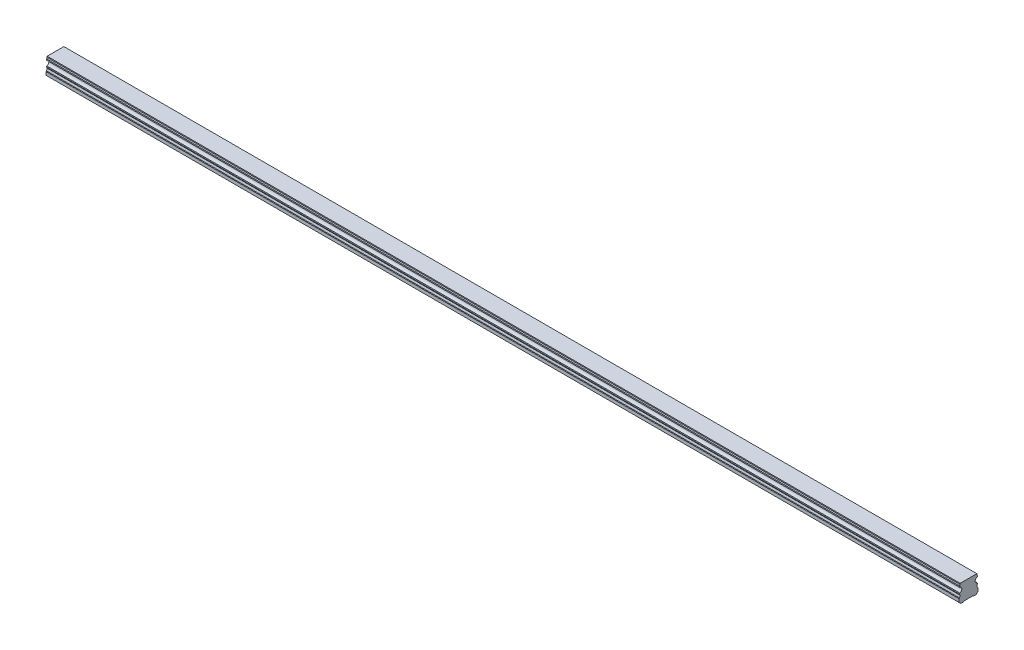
ISO-10303-21;
HEADER;
FILE_DESCRIPTION(('STEP AP214'),'2;1');
FILE_NAME('part.step','',(''),(''),'','','');
FILE_SCHEMA(('AUTOMOTIVE_DESIGN { 1 0 10303 214 1 1 1 1 }'));
ENDSEC;
DATA;
#1=APPLICATION_CONTEXT('core data for automotive mechanical design processes');
#2=APPLICATION_PROTOCOL_DEFINITION('international standard','automotive_design',2000,#1);
#3=PRODUCT_CONTEXT('',#1,'mechanical');
#4=PRODUCT('Part','Part','',(#3));
#5=PRODUCT_RELATED_PRODUCT_CATEGORY('part','',(#4));
#6=PRODUCT_DEFINITION_FORMATION('','',#4);
#7=PRODUCT_DEFINITION_CONTEXT('part definition',#1,'design');
#8=PRODUCT_DEFINITION('design','',#6,#7);
#9=PRODUCT_DEFINITION_SHAPE('','',#8);
#10=(LENGTH_UNIT() NAMED_UNIT(*) SI_UNIT(.MILLI.,.METRE.));
#11=(NAMED_UNIT(*) PLANE_ANGLE_UNIT() SI_UNIT($,.RADIAN.));
#12=(NAMED_UNIT(*) SI_UNIT($,.STERADIAN.) SOLID_ANGLE_UNIT());
#13=UNCERTAINTY_MEASURE_WITH_UNIT(LENGTH_MEASURE(1.E-05),#10,'distance_accuracy_value','');
#14=(GEOMETRIC_REPRESENTATION_CONTEXT(3) GLOBAL_UNCERTAINTY_ASSIGNED_CONTEXT((#13)) GLOBAL_UNIT_ASSIGNED_CONTEXT((#10,
#11,#12)) REPRESENTATION_CONTEXT('',''));
#15=CARTESIAN_POINT('',(0.,0.,0.));
#16=DIRECTION('',(0.,0.,1.));
#17=DIRECTION('',(1.,0.,0.));
#18=AXIS2_PLACEMENT_3D('',#15,#16,#17);
#19=CARTESIAN_POINT('',(690.,0.399999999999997,0.));
#20=DIRECTION('',(0.,-1.,0.));
#21=DIRECTION('',(0.,0.,-1.));
#22=AXIS2_PLACEMENT_3D('',#19,#20,#21);
#23=CONICAL_SURFACE('',#22,2.8999999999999,0.785398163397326);
#24=CARTESIAN_POINT('',(690.,0.799999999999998,0.));
#25=DIRECTION('',(0.,1.,0.));
#26=DIRECTION('',(0.,0.,1.));
#27=AXIS2_PLACEMENT_3D('',#24,#25,#26);
#28=CIRCLE('',#27,2.5);
#29=CARTESIAN_POINT('',(690.,0.8,2.5));
#30=VERTEX_POINT('',#29);
#31=EDGE_CURVE('E11',#30,#30,#28,.F.);
#32=ORIENTED_EDGE('',*,*,#31,.F.);
#33=EDGE_LOOP('',(#32));
#34=FACE_BOUND('',#33,.T.);
#35=CARTESIAN_POINT('',(690.,0.399999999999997,0.));
#36=DIRECTION('',(0.,1.,0.));
#37=DIRECTION('',(0.,0.,1.));
#38=AXIS2_PLACEMENT_3D('',#35,#36,#37);
#39=CIRCLE('',#38,2.89999999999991);
#40=CARTESIAN_POINT('',(690.,0.399999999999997,2.89999999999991));
#41=VERTEX_POINT('',#40);
#42=EDGE_CURVE('E541',#41,#41,#39,.T.);
#43=ORIENTED_EDGE('',*,*,#42,.F.);
#44=EDGE_LOOP('',(#43));
#45=FACE_BOUND('',#44,.T.);
#46=ADVANCED_FACE('F39',(#34,#45),#23,.F.);
#47=CARTESIAN_POINT('',(690.,7.,0.));
#48=DIRECTION('',(0.,-1.,0.));
#49=DIRECTION('',(0.,0.,-1.));
#50=AXIS2_PLACEMENT_3D('',#47,#48,#49);
#51=CYLINDRICAL_SURFACE('',#50,2.5);
#52=ORIENTED_EDGE('',*,*,#31,.T.);
#53=EDGE_LOOP('',(#52));
#54=FACE_BOUND('',#53,.T.);
#55=CARTESIAN_POINT('',(690.,7.,0.));
#56=DIRECTION('',(0.,-1.,0.));
#57=DIRECTION('',(0.,0.,-1.));
#58=AXIS2_PLACEMENT_3D('',#55,#56,#57);
#59=CIRCLE('',#58,2.5);
#60=CARTESIAN_POINT('',(690.,7.,-2.50000000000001));
#61=VERTEX_POINT('',#60);
#62=EDGE_CURVE('E49',#61,#61,#59,.T.);
#63=ORIENTED_EDGE('',*,*,#62,.F.);
#64=EDGE_LOOP('',(#63));
#65=FACE_BOUND('',#64,.T.);
#66=ADVANCED_FACE('F739',(#54,#65),#51,.F.);
#67=CARTESIAN_POINT('',(690.,7.,0.));
#68=DIRECTION('',(0.,-1.,0.));
#69=DIRECTION('',(0.,0.,-1.));
#70=AXIS2_PLACEMENT_3D('',#67,#68,#69);
#71=PLANE('',#70);
#72=CARTESIAN_POINT('',(690.,7.,0.));
#73=DIRECTION('',(0.,-1.,0.));
#74=DIRECTION('',(0.,0.,-1.));
#75=AXIS2_PLACEMENT_3D('',#72,#73,#74);
#76=CIRCLE('',#75,2.1);
#77=CARTESIAN_POINT('',(690.,7.,-2.1));
#78=VERTEX_POINT('',#77);
#79=EDGE_CURVE('E42',#78,#78,#76,.T.);
#80=ORIENTED_EDGE('',*,*,#79,.F.);
#81=EDGE_LOOP('',(#80));
#82=FACE_BOUND('',#81,.T.);
#83=ORIENTED_EDGE('',*,*,#62,.T.);
#84=EDGE_LOOP('',(#83));
#85=FACE_BOUND('',#84,.T.);
#86=ADVANCED_FACE('F744',(#82,#85),#71,.T.);
#87=CARTESIAN_POINT('',(630.,0.399999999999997,0.));
#88=DIRECTION('',(0.,-1.,0.));
#89=DIRECTION('',(0.,0.,-1.));
#90=AXIS2_PLACEMENT_3D('',#87,#88,#89);
#91=CONICAL_SURFACE('',#90,2.8999999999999,0.785398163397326);
#92=CARTESIAN_POINT('',(630.,0.799999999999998,0.));
#93=DIRECTION('',(0.,1.,0.));
#94=DIRECTION('',(0.,0.,1.));
#95=AXIS2_PLACEMENT_3D('',#92,#93,#94);
#96=CIRCLE('',#95,2.5);
#97=CARTESIAN_POINT('',(630.,0.8,2.5));
#98=VERTEX_POINT('',#97);
#99=EDGE_CURVE('E537',#98,#98,#96,.F.);
#100=ORIENTED_EDGE('',*,*,#99,.F.);
#101=EDGE_LOOP('',(#100));
#102=FACE_BOUND('',#101,.T.);
#103=CARTESIAN_POINT('',(630.,0.399999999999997,0.));
#104=DIRECTION('',(0.,1.,0.));
#105=DIRECTION('',(0.,0.,1.));
#106=AXIS2_PLACEMENT_3D('',#103,#104,#105);
#107=CIRCLE('',#106,2.89999999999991);
#108=CARTESIAN_POINT('',(630.,0.399999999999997,2.89999999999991));
#109=VERTEX_POINT('',#108);
#110=EDGE_CURVE('E529',#109,#109,#107,.T.);
#111=ORIENTED_EDGE('',*,*,#110,.F.);
#112=EDGE_LOOP('',(#111));
#113=FACE_BOUND('',#112,.T.);
#114=ADVANCED_FACE('F927',(#102,#113),#91,.F.);
#115=CARTESIAN_POINT('',(630.,7.,0.));
#116=DIRECTION('',(0.,-1.,0.));
#117=DIRECTION('',(0.,0.,-1.));
#118=AXIS2_PLACEMENT_3D('',#115,#116,#117);
#119=CYLINDRICAL_SURFACE('',#118,2.5);
#120=ORIENTED_EDGE('',*,*,#99,.T.);
#121=EDGE_LOOP('',(#120));
#122=FACE_BOUND('',#121,.T.);
#123=CARTESIAN_POINT('',(630.,7.,0.));
#124=DIRECTION('',(0.,-1.,0.));
#125=DIRECTION('',(0.,0.,-1.));
#126=AXIS2_PLACEMENT_3D('',#123,#124,#125);
#127=CIRCLE('',#126,2.5);
#128=CARTESIAN_POINT('',(630.,7.,-2.50000000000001));
#129=VERTEX_POINT('',#128);
#130=EDGE_CURVE('E533',#129,#129,#127,.T.);
#131=ORIENTED_EDGE('',*,*,#130,.F.);
#132=EDGE_LOOP('',(#131));
#133=FACE_BOUND('',#132,.T.);
#134=ADVANCED_FACE('F923',(#122,#133),#119,.F.);
#135=CARTESIAN_POINT('',(630.,7.,0.));
#136=DIRECTION('',(0.,-1.,0.));
#137=DIRECTION('',(0.,0.,-1.));
#138=AXIS2_PLACEMENT_3D('',#135,#136,#137);
#139=PLANE('',#138);
#140=CARTESIAN_POINT('',(630.,7.,0.));
#141=DIRECTION('',(0.,-1.,0.));
#142=DIRECTION('',(0.,0.,-1.));
#143=AXIS2_PLACEMENT_3D('',#140,#141,#142);
#144=CIRCLE('',#143,2.1);
#145=CARTESIAN_POINT('',(630.,7.,-2.1));
#146=VERTEX_POINT('',#145);
#147=EDGE_CURVE('E584',#146,#146,#144,.T.);
#148=ORIENTED_EDGE('',*,*,#147,.F.);
#149=EDGE_LOOP('',(#148));
#150=FACE_BOUND('',#149,.T.);
#151=ORIENTED_EDGE('',*,*,#130,.T.);
#152=EDGE_LOOP('',(#151));
#153=FACE_BOUND('',#152,.T.);
#154=ADVANCED_FACE('F919',(#150,#153),#139,.T.);
#155=CARTESIAN_POINT('',(570.,0.399999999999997,0.));
#156=DIRECTION('',(0.,-1.,0.));
#157=DIRECTION('',(0.,0.,-1.));
#158=AXIS2_PLACEMENT_3D('',#155,#156,#157);
#159=CONICAL_SURFACE('',#158,2.8999999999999,0.785398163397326);
#160=CARTESIAN_POINT('',(570.,0.799999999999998,0.));
#161=DIRECTION('',(0.,1.,0.));
#162=DIRECTION('',(0.,0.,1.));
#163=AXIS2_PLACEMENT_3D('',#160,#161,#162);
#164=CIRCLE('',#163,2.5);
#165=CARTESIAN_POINT('',(570.,0.8,2.5));
#166=VERTEX_POINT('',#165);
#167=EDGE_CURVE('E525',#166,#166,#164,.F.);
#168=ORIENTED_EDGE('',*,*,#167,.F.);
#169=EDGE_LOOP('',(#168));
#170=FACE_BOUND('',#169,.T.);
#171=CARTESIAN_POINT('',(570.,0.399999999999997,0.));
#172=DIRECTION('',(0.,1.,0.));
#173=DIRECTION('',(0.,0.,1.));
#174=AXIS2_PLACEMENT_3D('',#171,#172,#173);
#175=CIRCLE('',#174,2.89999999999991);
#176=CARTESIAN_POINT('',(570.,0.399999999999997,2.89999999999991));
#177=VERTEX_POINT('',#176);
#178=EDGE_CURVE('E517',#177,#177,#175,.T.);
#179=ORIENTED_EDGE('',*,*,#178,.F.);
#180=EDGE_LOOP('',(#179));
#181=FACE_BOUND('',#180,.T.);
#182=ADVANCED_FACE('F915',(#170,#181),#159,.F.);
#183=CARTESIAN_POINT('',(570.,7.,0.));
#184=DIRECTION('',(0.,-1.,0.));
#185=DIRECTION('',(0.,0.,-1.));
#186=AXIS2_PLACEMENT_3D('',#183,#184,#185);
#187=CYLINDRICAL_SURFACE('',#186,2.5);
#188=ORIENTED_EDGE('',*,*,#167,.T.);
#189=EDGE_LOOP('',(#188));
#190=FACE_BOUND('',#189,.T.);
#191=CARTESIAN_POINT('',(570.,7.,0.));
#192=DIRECTION('',(0.,-1.,0.));
#193=DIRECTION('',(0.,0.,-1.));
#194=AXIS2_PLACEMENT_3D('',#191,#192,#193);
#195=CIRCLE('',#194,2.5);
#196=CARTESIAN_POINT('',(570.,7.,-2.50000000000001));
#197=VERTEX_POINT('',#196);
#198=EDGE_CURVE('E521',#197,#197,#195,.T.);
#199=ORIENTED_EDGE('',*,*,#198,.F.);
#200=EDGE_LOOP('',(#199));
#201=FACE_BOUND('',#200,.T.);
#202=ADVANCED_FACE('F911',(#190,#201),#187,.F.);
#203=CARTESIAN_POINT('',(570.,7.,0.));
#204=DIRECTION('',(0.,-1.,0.));
#205=DIRECTION('',(0.,0.,-1.));
#206=AXIS2_PLACEMENT_3D('',#203,#204,#205);
#207=PLANE('',#206);
#208=CARTESIAN_POINT('',(570.,7.,0.));
#209=DIRECTION('',(0.,-1.,0.));
#210=DIRECTION('',(0.,0.,-1.));
#211=AXIS2_PLACEMENT_3D('',#208,#209,#210);
#212=CIRCLE('',#211,2.1);
#213=CARTESIAN_POINT('',(570.,7.,-2.1));
#214=VERTEX_POINT('',#213);
#215=EDGE_CURVE('E581',#214,#214,#212,.T.);
#216=ORIENTED_EDGE('',*,*,#215,.F.);
#217=EDGE_LOOP('',(#216));
#218=FACE_BOUND('',#217,.T.);
#219=ORIENTED_EDGE('',*,*,#198,.T.);
#220=EDGE_LOOP('',(#219));
#221=FACE_BOUND('',#220,.T.);
#222=ADVANCED_FACE('F907',(#218,#221),#207,.T.);
#223=CARTESIAN_POINT('',(510.,0.399999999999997,0.));
#224=DIRECTION('',(0.,-1.,0.));
#225=DIRECTION('',(0.,0.,-1.));
#226=AXIS2_PLACEMENT_3D('',#223,#224,#225);
#227=CONICAL_SURFACE('',#226,2.8999999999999,0.785398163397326);
#228=CARTESIAN_POINT('',(510.,0.799999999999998,0.));
#229=DIRECTION('',(0.,1.,0.));
#230=DIRECTION('',(0.,0.,1.));
#231=AXIS2_PLACEMENT_3D('',#228,#229,#230);
#232=CIRCLE('',#231,2.5);
#233=CARTESIAN_POINT('',(510.,0.8,2.5));
#234=VERTEX_POINT('',#233);
#235=EDGE_CURVE('E513',#234,#234,#232,.F.);
#236=ORIENTED_EDGE('',*,*,#235,.F.);
#237=EDGE_LOOP('',(#236));
#238=FACE_BOUND('',#237,.T.);
#239=CARTESIAN_POINT('',(510.,0.399999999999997,0.));
#240=DIRECTION('',(0.,1.,0.));
#241=DIRECTION('',(0.,0.,1.));
#242=AXIS2_PLACEMENT_3D('',#239,#240,#241);
#243=CIRCLE('',#242,2.89999999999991);
#244=CARTESIAN_POINT('',(510.,0.399999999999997,2.89999999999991));
#245=VERTEX_POINT('',#244);
#246=EDGE_CURVE('E505',#245,#245,#243,.T.);
#247=ORIENTED_EDGE('',*,*,#246,.F.);
#248=EDGE_LOOP('',(#247));
#249=FACE_BOUND('',#248,.T.);
#250=ADVANCED_FACE('F903',(#238,#249),#227,.F.);
#251=CARTESIAN_POINT('',(510.,7.,0.));
#252=DIRECTION('',(0.,-1.,0.));
#253=DIRECTION('',(0.,0.,-1.));
#254=AXIS2_PLACEMENT_3D('',#251,#252,#253);
#255=CYLINDRICAL_SURFACE('',#254,2.5);
#256=ORIENTED_EDGE('',*,*,#235,.T.);
#257=EDGE_LOOP('',(#256));
#258=FACE_BOUND('',#257,.T.);
#259=CARTESIAN_POINT('',(510.,7.,0.));
#260=DIRECTION('',(0.,-1.,0.));
#261=DIRECTION('',(0.,0.,-1.));
#262=AXIS2_PLACEMENT_3D('',#259,#260,#261);
#263=CIRCLE('',#262,2.5);
#264=CARTESIAN_POINT('',(510.,7.,-2.50000000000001));
#265=VERTEX_POINT('',#264);
#266=EDGE_CURVE('E509',#265,#265,#263,.T.);
#267=ORIENTED_EDGE('',*,*,#266,.F.);
#268=EDGE_LOOP('',(#267));
#269=FACE_BOUND('',#268,.T.);
#270=ADVANCED_FACE('F899',(#258,#269),#255,.F.);
#271=CARTESIAN_POINT('',(510.,7.,0.));
#272=DIRECTION('',(0.,-1.,0.));
#273=DIRECTION('',(0.,0.,-1.));
#274=AXIS2_PLACEMENT_3D('',#271,#272,#273);
#275=PLANE('',#274);
#276=CARTESIAN_POINT('',(510.,7.,0.));
#277=DIRECTION('',(0.,-1.,0.));
#278=DIRECTION('',(0.,0.,-1.));
#279=AXIS2_PLACEMENT_3D('',#276,#277,#278);
#280=CIRCLE('',#279,2.1);
#281=CARTESIAN_POINT('',(510.,7.,-2.1));
#282=VERTEX_POINT('',#281);
#283=EDGE_CURVE('E577',#282,#282,#280,.T.);
#284=ORIENTED_EDGE('',*,*,#283,.F.);
#285=EDGE_LOOP('',(#284));
#286=FACE_BOUND('',#285,.T.);
#287=ORIENTED_EDGE('',*,*,#266,.T.);
#288=EDGE_LOOP('',(#287));
#289=FACE_BOUND('',#288,.T.);
#290=ADVANCED_FACE('F895',(#286,#289),#275,.T.);
#291=CARTESIAN_POINT('',(450.,0.399999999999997,0.));
#292=DIRECTION('',(0.,-1.,0.));
#293=DIRECTION('',(0.,0.,-1.));
#294=AXIS2_PLACEMENT_3D('',#291,#292,#293);
#295=CONICAL_SURFACE('',#294,2.8999999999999,0.785398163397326);
#296=CARTESIAN_POINT('',(450.,0.799999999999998,0.));
#297=DIRECTION('',(0.,1.,0.));
#298=DIRECTION('',(0.,0.,1.));
#299=AXIS2_PLACEMENT_3D('',#296,#297,#298);
#300=CIRCLE('',#299,2.5);
#301=CARTESIAN_POINT('',(450.,0.8,2.5));
#302=VERTEX_POINT('',#301);
#303=EDGE_CURVE('E501',#302,#302,#300,.F.);
#304=ORIENTED_EDGE('',*,*,#303,.F.);
#305=EDGE_LOOP('',(#304));
#306=FACE_BOUND('',#305,.T.);
#307=CARTESIAN_POINT('',(450.,0.399999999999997,0.));
#308=DIRECTION('',(0.,1.,0.));
#309=DIRECTION('',(0.,0.,1.));
#310=AXIS2_PLACEMENT_3D('',#307,#308,#309);
#311=CIRCLE('',#310,2.89999999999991);
#312=CARTESIAN_POINT('',(450.,0.399999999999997,2.89999999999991));
#313=VERTEX_POINT('',#312);
#314=EDGE_CURVE('E493',#313,#313,#311,.T.);
#315=ORIENTED_EDGE('',*,*,#314,.F.);
#316=EDGE_LOOP('',(#315));
#317=FACE_BOUND('',#316,.T.);
#318=ADVANCED_FACE('F891',(#306,#317),#295,.F.);
#319=CARTESIAN_POINT('',(450.,7.,0.));
#320=DIRECTION('',(0.,-1.,0.));
#321=DIRECTION('',(0.,0.,-1.));
#322=AXIS2_PLACEMENT_3D('',#319,#320,#321);
#323=CYLINDRICAL_SURFACE('',#322,2.5);
#324=ORIENTED_EDGE('',*,*,#303,.T.);
#325=EDGE_LOOP('',(#324));
#326=FACE_BOUND('',#325,.T.);
#327=CARTESIAN_POINT('',(450.,7.,0.));
#328=DIRECTION('',(0.,-1.,0.));
#329=DIRECTION('',(0.,0.,-1.));
#330=AXIS2_PLACEMENT_3D('',#327,#328,#329);
#331=CIRCLE('',#330,2.5);
#332=CARTESIAN_POINT('',(450.,7.,-2.50000000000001));
#333=VERTEX_POINT('',#332);
#334=EDGE_CURVE('E497',#333,#333,#331,.T.);
#335=ORIENTED_EDGE('',*,*,#334,.F.);
#336=EDGE_LOOP('',(#335));
#337=FACE_BOUND('',#336,.T.);
#338=ADVANCED_FACE('F887',(#326,#337),#323,.F.);
#339=CARTESIAN_POINT('',(450.,7.,0.));
#340=DIRECTION('',(0.,-1.,0.));
#341=DIRECTION('',(0.,0.,-1.));
#342=AXIS2_PLACEMENT_3D('',#339,#340,#341);
#343=PLANE('',#342);
#344=CARTESIAN_POINT('',(450.,7.,0.));
#345=DIRECTION('',(0.,-1.,0.));
#346=DIRECTION('',(0.,0.,-1.));
#347=AXIS2_PLACEMENT_3D('',#344,#345,#346);
#348=CIRCLE('',#347,2.1);
#349=CARTESIAN_POINT('',(450.,7.,-2.1));
#350=VERTEX_POINT('',#349);
#351=EDGE_CURVE('E573',#350,#350,#348,.T.);
#352=ORIENTED_EDGE('',*,*,#351,.F.);
#353=EDGE_LOOP('',(#352));
#354=FACE_BOUND('',#353,.T.);
#355=ORIENTED_EDGE('',*,*,#334,.T.);
#356=EDGE_LOOP('',(#355));
#357=FACE_BOUND('',#356,.T.);
#358=ADVANCED_FACE('F883',(#354,#357),#343,.T.);
#359=CARTESIAN_POINT('',(390.,0.399999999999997,0.));
#360=DIRECTION('',(0.,-1.,0.));
#361=DIRECTION('',(0.,0.,-1.));
#362=AXIS2_PLACEMENT_3D('',#359,#360,#361);
#363=CONICAL_SURFACE('',#362,2.8999999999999,0.785398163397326);
#364=CARTESIAN_POINT('',(390.,0.799999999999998,0.));
#365=DIRECTION('',(0.,1.,0.));
#366=DIRECTION('',(0.,0.,1.));
#367=AXIS2_PLACEMENT_3D('',#364,#365,#366);
#368=CIRCLE('',#367,2.5);
#369=CARTESIAN_POINT('',(390.,0.8,2.5));
#370=VERTEX_POINT('',#369);
#371=EDGE_CURVE('E489',#370,#370,#368,.F.);
#372=ORIENTED_EDGE('',*,*,#371,.F.);
#373=EDGE_LOOP('',(#372));
#374=FACE_BOUND('',#373,.T.);
#375=CARTESIAN_POINT('',(390.,0.399999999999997,0.));
#376=DIRECTION('',(0.,1.,0.));
#377=DIRECTION('',(0.,0.,1.));
#378=AXIS2_PLACEMENT_3D('',#375,#376,#377);
#379=CIRCLE('',#378,2.89999999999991);
#380=CARTESIAN_POINT('',(390.,0.399999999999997,2.89999999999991));
#381=VERTEX_POINT('',#380);
#382=EDGE_CURVE('E481',#381,#381,#379,.T.);
#383=ORIENTED_EDGE('',*,*,#382,.F.);
#384=EDGE_LOOP('',(#383));
#385=FACE_BOUND('',#384,.T.);
#386=ADVANCED_FACE('F879',(#374,#385),#363,.F.);
#387=CARTESIAN_POINT('',(390.,7.,0.));
#388=DIRECTION('',(0.,-1.,0.));
#389=DIRECTION('',(0.,0.,-1.));
#390=AXIS2_PLACEMENT_3D('',#387,#388,#389);
#391=CYLINDRICAL_SURFACE('',#390,2.5);
#392=ORIENTED_EDGE('',*,*,#371,.T.);
#393=EDGE_LOOP('',(#392));
#394=FACE_BOUND('',#393,.T.);
#395=CARTESIAN_POINT('',(390.,7.,0.));
#396=DIRECTION('',(0.,-1.,0.));
#397=DIRECTION('',(0.,0.,-1.));
#398=AXIS2_PLACEMENT_3D('',#395,#396,#397);
#399=CIRCLE('',#398,2.5);
#400=CARTESIAN_POINT('',(390.,7.,-2.50000000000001));
#401=VERTEX_POINT('',#400);
#402=EDGE_CURVE('E485',#401,#401,#399,.T.);
#403=ORIENTED_EDGE('',*,*,#402,.F.);
#404=EDGE_LOOP('',(#403));
#405=FACE_BOUND('',#404,.T.);
#406=ADVANCED_FACE('F875',(#394,#405),#391,.F.);
#407=CARTESIAN_POINT('',(390.,7.,0.));
#408=DIRECTION('',(0.,-1.,0.));
#409=DIRECTION('',(0.,0.,-1.));
#410=AXIS2_PLACEMENT_3D('',#407,#408,#409);
#411=PLANE('',#410);
#412=CARTESIAN_POINT('',(390.,7.,0.));
#413=DIRECTION('',(0.,-1.,0.));
#414=DIRECTION('',(0.,0.,-1.));
#415=AXIS2_PLACEMENT_3D('',#412,#413,#414);
#416=CIRCLE('',#415,2.1);
#417=CARTESIAN_POINT('',(390.,7.,-2.1));
#418=VERTEX_POINT('',#417);
#419=EDGE_CURVE('E569',#418,#418,#416,.T.);
#420=ORIENTED_EDGE('',*,*,#419,.F.);
#421=EDGE_LOOP('',(#420));
#422=FACE_BOUND('',#421,.T.);
#423=ORIENTED_EDGE('',*,*,#402,.T.);
#424=EDGE_LOOP('',(#423));
#425=FACE_BOUND('',#424,.T.);
#426=ADVANCED_FACE('F871',(#422,#425),#411,.T.);
#427=CARTESIAN_POINT('',(330.,0.399999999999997,0.));
#428=DIRECTION('',(0.,-1.,0.));
#429=DIRECTION('',(0.,0.,-1.));
#430=AXIS2_PLACEMENT_3D('',#427,#428,#429);
#431=CONICAL_SURFACE('',#430,2.8999999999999,0.785398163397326);
#432=CARTESIAN_POINT('',(330.,0.799999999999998,0.));
#433=DIRECTION('',(0.,1.,0.));
#434=DIRECTION('',(0.,0.,1.));
#435=AXIS2_PLACEMENT_3D('',#432,#433,#434);
#436=CIRCLE('',#435,2.5);
#437=CARTESIAN_POINT('',(330.,0.8,2.5));
#438=VERTEX_POINT('',#437);
#439=EDGE_CURVE('E477',#438,#438,#436,.F.);
#440=ORIENTED_EDGE('',*,*,#439,.F.);
#441=EDGE_LOOP('',(#440));
#442=FACE_BOUND('',#441,.T.);
#443=CARTESIAN_POINT('',(330.,0.399999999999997,0.));
#444=DIRECTION('',(0.,1.,0.));
#445=DIRECTION('',(0.,0.,1.));
#446=AXIS2_PLACEMENT_3D('',#443,#444,#445);
#447=CIRCLE('',#446,2.89999999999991);
#448=CARTESIAN_POINT('',(330.,0.399999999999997,2.89999999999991));
#449=VERTEX_POINT('',#448);
#450=EDGE_CURVE('E469',#449,#449,#447,.T.);
#451=ORIENTED_EDGE('',*,*,#450,.F.);
#452=EDGE_LOOP('',(#451));
#453=FACE_BOUND('',#452,.T.);
#454=ADVANCED_FACE('F867',(#442,#453),#431,.F.);
#455=CARTESIAN_POINT('',(330.,7.,0.));
#456=DIRECTION('',(0.,-1.,0.));
#457=DIRECTION('',(0.,0.,-1.));
#458=AXIS2_PLACEMENT_3D('',#455,#456,#457);
#459=CYLINDRICAL_SURFACE('',#458,2.5);
#460=ORIENTED_EDGE('',*,*,#439,.T.);
#461=EDGE_LOOP('',(#460));
#462=FACE_BOUND('',#461,.T.);
#463=CARTESIAN_POINT('',(330.,7.,0.));
#464=DIRECTION('',(0.,-1.,0.));
#465=DIRECTION('',(0.,0.,-1.));
#466=AXIS2_PLACEMENT_3D('',#463,#464,#465);
#467=CIRCLE('',#466,2.5);
#468=CARTESIAN_POINT('',(330.,7.,-2.50000000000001));
#469=VERTEX_POINT('',#468);
#470=EDGE_CURVE('E473',#469,#469,#467,.T.);
#471=ORIENTED_EDGE('',*,*,#470,.F.);
#472=EDGE_LOOP('',(#471));
#473=FACE_BOUND('',#472,.T.);
#474=ADVANCED_FACE('F863',(#462,#473),#459,.F.);
#475=CARTESIAN_POINT('',(330.,7.,0.));
#476=DIRECTION('',(0.,-1.,0.));
#477=DIRECTION('',(0.,0.,-1.));
#478=AXIS2_PLACEMENT_3D('',#475,#476,#477);
#479=PLANE('',#478);
#480=CARTESIAN_POINT('',(330.,7.,0.));
#481=DIRECTION('',(0.,-1.,0.));
#482=DIRECTION('',(0.,0.,-1.));
#483=AXIS2_PLACEMENT_3D('',#480,#481,#482);
#484=CIRCLE('',#483,2.1);
#485=CARTESIAN_POINT('',(330.,7.,-2.1));
#486=VERTEX_POINT('',#485);
#487=EDGE_CURVE('E565',#486,#486,#484,.T.);
#488=ORIENTED_EDGE('',*,*,#487,.F.);
#489=EDGE_LOOP('',(#488));
#490=FACE_BOUND('',#489,.T.);
#491=ORIENTED_EDGE('',*,*,#470,.T.);
#492=EDGE_LOOP('',(#491));
#493=FACE_BOUND('',#492,.T.);
#494=ADVANCED_FACE('F859',(#490,#493),#479,.T.);
#495=CARTESIAN_POINT('',(270.,0.399999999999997,0.));
#496=DIRECTION('',(0.,-1.,0.));
#497=DIRECTION('',(0.,0.,-1.));
#498=AXIS2_PLACEMENT_3D('',#495,#496,#497);
#499=CONICAL_SURFACE('',#498,2.8999999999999,0.785398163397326);
#500=CARTESIAN_POINT('',(270.,0.799999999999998,0.));
#501=DIRECTION('',(0.,1.,0.));
#502=DIRECTION('',(0.,0.,1.));
#503=AXIS2_PLACEMENT_3D('',#500,#501,#502);
#504=CIRCLE('',#503,2.5);
#505=CARTESIAN_POINT('',(270.,0.8,2.5));
#506=VERTEX_POINT('',#505);
#507=EDGE_CURVE('E465',#506,#506,#504,.F.);
#508=ORIENTED_EDGE('',*,*,#507,.F.);
#509=EDGE_LOOP('',(#508));
#510=FACE_BOUND('',#509,.T.);
#511=CARTESIAN_POINT('',(270.,0.399999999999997,0.));
#512=DIRECTION('',(0.,1.,0.));
#513=DIRECTION('',(0.,0.,1.));
#514=AXIS2_PLACEMENT_3D('',#511,#512,#513);
#515=CIRCLE('',#514,2.89999999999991);
#516=CARTESIAN_POINT('',(270.,0.399999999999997,2.89999999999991));
#517=VERTEX_POINT('',#516);
#518=EDGE_CURVE('E457',#517,#517,#515,.T.);
#519=ORIENTED_EDGE('',*,*,#518,.F.);
#520=EDGE_LOOP('',(#519));
#521=FACE_BOUND('',#520,.T.);
#522=ADVANCED_FACE('F855',(#510,#521),#499,.F.);
#523=CARTESIAN_POINT('',(270.,7.,0.));
#524=DIRECTION('',(0.,-1.,0.));
#525=DIRECTION('',(0.,0.,-1.));
#526=AXIS2_PLACEMENT_3D('',#523,#524,#525);
#527=CYLINDRICAL_SURFACE('',#526,2.5);
#528=ORIENTED_EDGE('',*,*,#507,.T.);
#529=EDGE_LOOP('',(#528));
#530=FACE_BOUND('',#529,.T.);
#531=CARTESIAN_POINT('',(270.,7.,0.));
#532=DIRECTION('',(0.,-1.,0.));
#533=DIRECTION('',(0.,0.,-1.));
#534=AXIS2_PLACEMENT_3D('',#531,#532,#533);
#535=CIRCLE('',#534,2.5);
#536=CARTESIAN_POINT('',(270.,7.,-2.50000000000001));
#537=VERTEX_POINT('',#536);
#538=EDGE_CURVE('E461',#537,#537,#535,.T.);
#539=ORIENTED_EDGE('',*,*,#538,.F.);
#540=EDGE_LOOP('',(#539));
#541=FACE_BOUND('',#540,.T.);
#542=ADVANCED_FACE('F851',(#530,#541),#527,.F.);
#543=CARTESIAN_POINT('',(270.,7.,0.));
#544=DIRECTION('',(0.,-1.,0.));
#545=DIRECTION('',(0.,0.,-1.));
#546=AXIS2_PLACEMENT_3D('',#543,#544,#545);
#547=PLANE('',#546);
#548=CARTESIAN_POINT('',(270.,7.,0.));
#549=DIRECTION('',(0.,-1.,0.));
#550=DIRECTION('',(0.,0.,-1.));
#551=AXIS2_PLACEMENT_3D('',#548,#549,#550);
#552=CIRCLE('',#551,2.1);
#553=CARTESIAN_POINT('',(270.,7.,-2.1));
#554=VERTEX_POINT('',#553);
#555=EDGE_CURVE('E561',#554,#554,#552,.T.);
#556=ORIENTED_EDGE('',*,*,#555,.F.);
#557=EDGE_LOOP('',(#556));
#558=FACE_BOUND('',#557,.T.);
#559=ORIENTED_EDGE('',*,*,#538,.T.);
#560=EDGE_LOOP('',(#559));
#561=FACE_BOUND('',#560,.T.);
#562=ADVANCED_FACE('F847',(#558,#561),#547,.T.);
#563=CARTESIAN_POINT('',(210.,0.399999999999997,0.));
#564=DIRECTION('',(0.,-1.,0.));
#565=DIRECTION('',(0.,0.,-1.));
#566=AXIS2_PLACEMENT_3D('',#563,#564,#565);
#567=CONICAL_SURFACE('',#566,2.8999999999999,0.785398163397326);
#568=CARTESIAN_POINT('',(210.,0.799999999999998,0.));
#569=DIRECTION('',(0.,1.,0.));
#570=DIRECTION('',(0.,0.,1.));
#571=AXIS2_PLACEMENT_3D('',#568,#569,#570);
#572=CIRCLE('',#571,2.5);
#573=CARTESIAN_POINT('',(210.,0.8,2.5));
#574=VERTEX_POINT('',#573);
#575=EDGE_CURVE('E453',#574,#574,#572,.F.);
#576=ORIENTED_EDGE('',*,*,#575,.F.);
#577=EDGE_LOOP('',(#576));
#578=FACE_BOUND('',#577,.T.);
#579=CARTESIAN_POINT('',(210.,0.399999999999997,0.));
#580=DIRECTION('',(0.,1.,0.));
#581=DIRECTION('',(0.,0.,1.));
#582=AXIS2_PLACEMENT_3D('',#579,#580,#581);
#583=CIRCLE('',#582,2.89999999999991);
#584=CARTESIAN_POINT('',(210.,0.399999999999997,2.89999999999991));
#585=VERTEX_POINT('',#584);
#586=EDGE_CURVE('E445',#585,#585,#583,.T.);
#587=ORIENTED_EDGE('',*,*,#586,.F.);
#588=EDGE_LOOP('',(#587));
#589=FACE_BOUND('',#588,.T.);
#590=ADVANCED_FACE('F843',(#578,#589),#567,.F.);
#591=CARTESIAN_POINT('',(210.,7.,0.));
#592=DIRECTION('',(0.,-1.,0.));
#593=DIRECTION('',(0.,0.,-1.));
#594=AXIS2_PLACEMENT_3D('',#591,#592,#593);
#595=CYLINDRICAL_SURFACE('',#594,2.5);
#596=ORIENTED_EDGE('',*,*,#575,.T.);
#597=EDGE_LOOP('',(#596));
#598=FACE_BOUND('',#597,.T.);
#599=CARTESIAN_POINT('',(210.,7.,0.));
#600=DIRECTION('',(0.,-1.,0.));
#601=DIRECTION('',(0.,0.,-1.));
#602=AXIS2_PLACEMENT_3D('',#599,#600,#601);
#603=CIRCLE('',#602,2.5);
#604=CARTESIAN_POINT('',(210.,7.,-2.50000000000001));
#605=VERTEX_POINT('',#604);
#606=EDGE_CURVE('E449',#605,#605,#603,.T.);
#607=ORIENTED_EDGE('',*,*,#606,.F.);
#608=EDGE_LOOP('',(#607));
#609=FACE_BOUND('',#608,.T.);
#610=ADVANCED_FACE('F839',(#598,#609),#595,.F.);
#611=CARTESIAN_POINT('',(210.,7.,0.));
#612=DIRECTION('',(0.,-1.,0.));
#613=DIRECTION('',(0.,0.,-1.));
#614=AXIS2_PLACEMENT_3D('',#611,#612,#613);
#615=PLANE('',#614);
#616=CARTESIAN_POINT('',(210.,7.,0.));
#617=DIRECTION('',(0.,-1.,0.));
#618=DIRECTION('',(0.,0.,-1.));
#619=AXIS2_PLACEMENT_3D('',#616,#617,#618);
#620=CIRCLE('',#619,2.1);
#621=CARTESIAN_POINT('',(210.,7.,-2.1));
#622=VERTEX_POINT('',#621);
#623=EDGE_CURVE('E557',#622,#622,#620,.T.);
#624=ORIENTED_EDGE('',*,*,#623,.F.);
#625=EDGE_LOOP('',(#624));
#626=FACE_BOUND('',#625,.T.);
#627=ORIENTED_EDGE('',*,*,#606,.T.);
#628=EDGE_LOOP('',(#627));
#629=FACE_BOUND('',#628,.T.);
#630=ADVANCED_FACE('F835',(#626,#629),#615,.T.);
#631=CARTESIAN_POINT('',(150.,0.399999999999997,0.));
#632=DIRECTION('',(0.,-1.,0.));
#633=DIRECTION('',(0.,0.,-1.));
#634=AXIS2_PLACEMENT_3D('',#631,#632,#633);
#635=CONICAL_SURFACE('',#634,2.8999999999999,0.785398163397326);
#636=CARTESIAN_POINT('',(150.,0.799999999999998,0.));
#637=DIRECTION('',(0.,1.,0.));
#638=DIRECTION('',(0.,0.,1.));
#639=AXIS2_PLACEMENT_3D('',#636,#637,#638);
#640=CIRCLE('',#639,2.5);
#641=CARTESIAN_POINT('',(150.,0.8,2.5));
#642=VERTEX_POINT('',#641);
#643=EDGE_CURVE('E441',#642,#642,#640,.F.);
#644=ORIENTED_EDGE('',*,*,#643,.F.);
#645=EDGE_LOOP('',(#644));
#646=FACE_BOUND('',#645,.T.);
#647=CARTESIAN_POINT('',(150.,0.399999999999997,0.));
#648=DIRECTION('',(0.,1.,0.));
#649=DIRECTION('',(0.,0.,1.));
#650=AXIS2_PLACEMENT_3D('',#647,#648,#649);
#651=CIRCLE('',#650,2.89999999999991);
#652=CARTESIAN_POINT('',(150.,0.399999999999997,2.89999999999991));
#653=VERTEX_POINT('',#652);
#654=EDGE_CURVE('E433',#653,#653,#651,.T.);
#655=ORIENTED_EDGE('',*,*,#654,.F.);
#656=EDGE_LOOP('',(#655));
#657=FACE_BOUND('',#656,.T.);
#658=ADVANCED_FACE('F831',(#646,#657),#635,.F.);
#659=CARTESIAN_POINT('',(150.,7.,0.));
#660=DIRECTION('',(0.,-1.,0.));
#661=DIRECTION('',(0.,0.,-1.));
#662=AXIS2_PLACEMENT_3D('',#659,#660,#661);
#663=CYLINDRICAL_SURFACE('',#662,2.5);
#664=ORIENTED_EDGE('',*,*,#643,.T.);
#665=EDGE_LOOP('',(#664));
#666=FACE_BOUND('',#665,.T.);
#667=CARTESIAN_POINT('',(150.,7.,0.));
#668=DIRECTION('',(0.,-1.,0.));
#669=DIRECTION('',(0.,0.,-1.));
#670=AXIS2_PLACEMENT_3D('',#667,#668,#669);
#671=CIRCLE('',#670,2.5);
#672=CARTESIAN_POINT('',(150.,7.,-2.50000000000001));
#673=VERTEX_POINT('',#672);
#674=EDGE_CURVE('E437',#673,#673,#671,.T.);
#675=ORIENTED_EDGE('',*,*,#674,.F.);
#676=EDGE_LOOP('',(#675));
#677=FACE_BOUND('',#676,.T.);
#678=ADVANCED_FACE('F827',(#666,#677),#663,.F.);
#679=CARTESIAN_POINT('',(150.,7.,0.));
#680=DIRECTION('',(0.,-1.,0.));
#681=DIRECTION('',(0.,0.,-1.));
#682=AXIS2_PLACEMENT_3D('',#679,#680,#681);
#683=PLANE('',#682);
#684=CARTESIAN_POINT('',(150.,7.,0.));
#685=DIRECTION('',(0.,-1.,0.));
#686=DIRECTION('',(0.,0.,-1.));
#687=AXIS2_PLACEMENT_3D('',#684,#685,#686);
#688=CIRCLE('',#687,2.1);
#689=CARTESIAN_POINT('',(150.,7.,-2.1));
#690=VERTEX_POINT('',#689);
#691=EDGE_CURVE('E552',#690,#690,#688,.T.);
#692=ORIENTED_EDGE('',*,*,#691,.F.);
#693=EDGE_LOOP('',(#692));
#694=FACE_BOUND('',#693,.T.);
#695=ORIENTED_EDGE('',*,*,#674,.T.);
#696=EDGE_LOOP('',(#695));
#697=FACE_BOUND('',#696,.T.);
#698=ADVANCED_FACE('F817',(#694,#697),#683,.T.);
#699=CARTESIAN_POINT('',(720.,14.,-6.59000000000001));
#700=DIRECTION('',(0.,0.,1.));
#701=DIRECTION('',(0.,-1.,0.));
#702=AXIS2_PLACEMENT_3D('',#699,#700,#701);
#703=PLANE('',#702);
#704=DIRECTION('',(0.,1.,0.));
#705=VECTOR('',#704,1.);
#706=CARTESIAN_POINT('',(0.,14.,-6.59000000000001));
#707=LINE('',#706,#705);
#708=CARTESIAN_POINT('',(0.,13.15,-6.59));
#709=VERTEX_POINT('',#708);
#710=CARTESIAN_POINT('',(0.,14.,-6.59000000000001));
#711=VERTEX_POINT('',#710);
#712=EDGE_CURVE('E255',#709,#711,#707,.T.);
#713=ORIENTED_EDGE('',*,*,#712,.T.);
#714=DIRECTION('',(-1.,0.,0.));
#715=VECTOR('',#714,1.);
#716=CARTESIAN_POINT('',(720.,14.,-6.59000000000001));
#717=LINE('',#716,#715);
#718=CARTESIAN_POINT('',(720.,14.,-6.59000000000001));
#719=VERTEX_POINT('',#718);
#720=EDGE_CURVE('E422',#719,#711,#717,.T.);
#721=ORIENTED_EDGE('',*,*,#720,.F.);
#722=DIRECTION('',(0.,1.,0.));
#723=VECTOR('',#722,1.);
#724=CARTESIAN_POINT('',(720.,14.,-6.59000000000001));
#725=LINE('',#724,#723);
#726=CARTESIAN_POINT('',(720.,13.15,-6.59));
#727=VERTEX_POINT('',#726);
#728=EDGE_CURVE('E331',#727,#719,#725,.T.);
#729=ORIENTED_EDGE('',*,*,#728,.F.);
#730=DIRECTION('',(-1.,0.,0.));
#731=VECTOR('',#730,1.);
#732=CARTESIAN_POINT('',(720.,13.15,-6.59));
#733=LINE('',#732,#731);
#734=EDGE_CURVE('E251',#727,#709,#733,.T.);
#735=ORIENTED_EDGE('',*,*,#734,.T.);
#736=EDGE_LOOP('',(#713,#721,#729,#735));
#737=FACE_BOUND('',#736,.T.);
#738=ADVANCED_FACE('F814',(#737),#703,.F.);
#739=CARTESIAN_POINT('',(720.,14.,-6.59000000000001));
#740=DIRECTION('',(0.,-1.,0.));
#741=DIRECTION('',(0.,0.,-1.));
#742=AXIS2_PLACEMENT_3D('',#739,#740,#741);
#743=PLANE('',#742);
#744=DIRECTION('',(0.,0.,1.));
#745=VECTOR('',#744,1.);
#746=CARTESIAN_POINT('',(0.,14.,-6.59000000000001));
#747=LINE('',#746,#745);
#748=CARTESIAN_POINT('',(0.,14.,6.59));
#749=VERTEX_POINT('',#748);
#750=EDGE_CURVE('E259',#711,#749,#747,.T.);
#751=ORIENTED_EDGE('',*,*,#750,.T.);
#752=DIRECTION('',(-1.,0.,0.));
#753=VECTOR('',#752,1.);
#754=CARTESIAN_POINT('',(720.,14.,6.59));
#755=LINE('',#754,#753);
#756=CARTESIAN_POINT('',(720.,14.,6.59));
#757=VERTEX_POINT('',#756);
#758=EDGE_CURVE('E418',#757,#749,#755,.T.);
#759=ORIENTED_EDGE('',*,*,#758,.F.);
#760=DIRECTION('',(0.,0.,1.));
#761=VECTOR('',#760,1.);
#762=CARTESIAN_POINT('',(720.,14.,-6.59000000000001));
#763=LINE('',#762,#761);
#764=EDGE_CURVE('E157',#719,#757,#763,.T.);
#765=ORIENTED_EDGE('',*,*,#764,.F.);
#766=ORIENTED_EDGE('',*,*,#720,.T.);
#767=EDGE_LOOP('',(#751,#759,#765,#766));
#768=FACE_BOUND('',#767,.T.);
#769=ADVANCED_FACE('F810',(#768),#743,.F.);
#770=CARTESIAN_POINT('',(720.,14.,6.59));
#771=DIRECTION('',(0.,0.,-1.));
#772=DIRECTION('',(0.,1.,0.));
#773=AXIS2_PLACEMENT_3D('',#770,#771,#772);
#774=PLANE('',#773);
#775=DIRECTION('',(0.,-1.,0.));
#776=VECTOR('',#775,1.);
#777=CARTESIAN_POINT('',(0.,14.,6.59));
#778=LINE('',#777,#776);
#779=CARTESIAN_POINT('',(0.,13.15,6.59));
#780=VERTEX_POINT('',#779);
#781=EDGE_CURVE('E263',#749,#780,#778,.T.);
#782=ORIENTED_EDGE('',*,*,#781,.T.);
#783=DIRECTION('',(-1.,0.,0.));
#784=VECTOR('',#783,1.);
#785=CARTESIAN_POINT('',(720.,13.15,6.59));
#786=LINE('',#785,#784);
#787=CARTESIAN_POINT('',(720.,13.15,6.59));
#788=VERTEX_POINT('',#787);
#789=EDGE_CURVE('E414',#788,#780,#786,.T.);
#790=ORIENTED_EDGE('',*,*,#789,.F.);
#791=DIRECTION('',(0.,-1.,0.));
#792=VECTOR('',#791,1.);
#793=CARTESIAN_POINT('',(720.,14.,6.59));
#794=LINE('',#793,#792);
#795=EDGE_CURVE('E628',#757,#788,#794,.T.);
#796=ORIENTED_EDGE('',*,*,#795,.F.);
#797=ORIENTED_EDGE('',*,*,#758,.T.);
#798=EDGE_LOOP('',(#782,#790,#796,#797));
#799=FACE_BOUND('',#798,.T.);
#800=ADVANCED_FACE('F806',(#799),#774,.F.);
#801=CARTESIAN_POINT('',(720.,13.15,6.59));
#802=DIRECTION('',(0.,-0.422618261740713,-0.906307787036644));
#803=DIRECTION('',(0.,0.906307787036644,-0.422618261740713));
#804=AXIS2_PLACEMENT_3D('',#801,#802,#803);
#805=PLANE('',#804);
#806=DIRECTION('',(0.,-0.906307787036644,0.422618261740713));
#807=VECTOR('',#806,1.);
#808=CARTESIAN_POINT('',(0.,13.15,6.59));
#809=LINE('',#808,#807);
#810=CARTESIAN_POINT('',(0.,12.3565324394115,6.96));
#811=VERTEX_POINT('',#810);
#812=EDGE_CURVE('E266',#780,#811,#809,.T.);
#813=ORIENTED_EDGE('',*,*,#812,.T.);
#814=DIRECTION('',(-1.,0.,0.));
#815=VECTOR('',#814,1.);
#816=CARTESIAN_POINT('',(720.,12.3565324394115,6.96));
#817=LINE('',#816,#815);
#818=CARTESIAN_POINT('',(720.,12.3565324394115,6.96));
#819=VERTEX_POINT('',#818);
#820=EDGE_CURVE('E410',#819,#811,#817,.T.);
#821=ORIENTED_EDGE('',*,*,#820,.F.);
#822=DIRECTION('',(0.,-0.906307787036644,0.422618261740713));
#823=VECTOR('',#822,1.);
#824=CARTESIAN_POINT('',(720.,13.15,6.59));
#825=LINE('',#824,#823);
#826=EDGE_CURVE('E631',#788,#819,#825,.T.);
#827=ORIENTED_EDGE('',*,*,#826,.F.);
#828=ORIENTED_EDGE('',*,*,#789,.T.);
#829=EDGE_LOOP('',(#813,#821,#827,#828));
#830=FACE_BOUND('',#829,.T.);
#831=ADVANCED_FACE('F802',(#830),#805,.F.);
#832=CARTESIAN_POINT('',(720.,12.3565324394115,6.96));
#833=DIRECTION('',(0.,0.,-1.));
#834=DIRECTION('',(0.,1.,0.));
#835=AXIS2_PLACEMENT_3D('',#832,#833,#834);
#836=PLANE('',#835);
#837=DIRECTION('',(0.,-1.,0.));
#838=VECTOR('',#837,1.);
#839=CARTESIAN_POINT('',(0.,12.3565324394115,6.96));
#840=LINE('',#839,#838);
#841=CARTESIAN_POINT('',(0.,11.4351744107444,6.96));
#842=VERTEX_POINT('',#841);
#843=EDGE_CURVE('E269',#811,#842,#840,.T.);
#844=ORIENTED_EDGE('',*,*,#843,.T.);
#845=DIRECTION('',(-1.,0.,0.));
#846=VECTOR('',#845,1.);
#847=CARTESIAN_POINT('',(720.,11.4351744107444,6.96));
#848=LINE('',#847,#846);
#849=CARTESIAN_POINT('',(720.,11.4351744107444,6.96));
#850=VERTEX_POINT('',#849);
#851=EDGE_CURVE('E406',#850,#842,#848,.T.);
#852=ORIENTED_EDGE('',*,*,#851,.F.);
#853=DIRECTION('',(0.,-1.,0.));
#854=VECTOR('',#853,1.);
#855=CARTESIAN_POINT('',(720.,12.3565324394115,6.96));
#856=LINE('',#855,#854);
#857=EDGE_CURVE('E634',#819,#850,#856,.T.);
#858=ORIENTED_EDGE('',*,*,#857,.F.);
#859=ORIENTED_EDGE('',*,*,#820,.T.);
#860=EDGE_LOOP('',(#844,#852,#858,#859));
#861=FACE_BOUND('',#860,.T.);
#862=ADVANCED_FACE('F798',(#861),#836,.F.);
#863=CARTESIAN_POINT('',(720.,9.5,7.2));
#864=DIRECTION('',(-1.,0.,0.));
#865=DIRECTION('',(0.,0.,1.));
#866=AXIS2_PLACEMENT_3D('',#863,#864,#865);
#867=CYLINDRICAL_SURFACE('',#866,1.95);
#868=CARTESIAN_POINT('',(0.,9.5,7.2));
#869=DIRECTION('',(-1.,0.,0.));
#870=DIRECTION('',(0.,0.,-1.));
#871=AXIS2_PLACEMENT_3D('',#868,#869,#870);
#872=CIRCLE('',#871,1.95);
#873=CARTESIAN_POINT('',(0.,7.56482558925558,6.96));
#874=VERTEX_POINT('',#873);
#875=EDGE_CURVE('E272',#842,#874,#872,.T.);
#876=ORIENTED_EDGE('',*,*,#875,.T.);
#877=DIRECTION('',(-1.,0.,0.));
#878=VECTOR('',#877,1.);
#879=CARTESIAN_POINT('',(720.,7.56482558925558,6.96));
#880=LINE('',#879,#878);
#881=CARTESIAN_POINT('',(720.,7.56482558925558,6.96));
#882=VERTEX_POINT('',#881);
#883=EDGE_CURVE('E402',#882,#874,#880,.T.);
#884=ORIENTED_EDGE('',*,*,#883,.F.);
#885=CARTESIAN_POINT('',(720.,9.5,7.2));
#886=DIRECTION('',(-1.,0.,0.));
#887=DIRECTION('',(0.,0.,-1.));
#888=AXIS2_PLACEMENT_3D('',#885,#886,#887);
#889=CIRCLE('',#888,1.95);
#890=EDGE_CURVE('E637',#850,#882,#889,.T.);
#891=ORIENTED_EDGE('',*,*,#890,.F.);
#892=ORIENTED_EDGE('',*,*,#851,.T.);
#893=EDGE_LOOP('',(#876,#884,#891,#892));
#894=FACE_BOUND('',#893,.T.);
#895=ADVANCED_FACE('F794',(#894),#867,.F.);
#896=CARTESIAN_POINT('',(720.,7.56482558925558,6.96));
#897=DIRECTION('',(0.,0.,-1.));
#898=DIRECTION('',(0.,1.,0.));
#899=AXIS2_PLACEMENT_3D('',#896,#897,#898);
#900=PLANE('',#899);
#901=DIRECTION('',(0.,-1.,0.));
#902=VECTOR('',#901,1.);
#903=CARTESIAN_POINT('',(0.,7.56482558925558,6.96));
#904=LINE('',#903,#902);
#905=CARTESIAN_POINT('',(0.,6.64346756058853,6.96));
#906=VERTEX_POINT('',#905);
#907=EDGE_CURVE('E275',#874,#906,#904,.T.);
#908=ORIENTED_EDGE('',*,*,#907,.T.);
#909=DIRECTION('',(-1.,0.,0.));
#910=VECTOR('',#909,1.);
#911=CARTESIAN_POINT('',(720.,6.64346756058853,6.96));
#912=LINE('',#911,#910);
#913=CARTESIAN_POINT('',(720.,6.64346756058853,6.96));
#914=VERTEX_POINT('',#913);
#915=EDGE_CURVE('E398',#914,#906,#912,.T.);
#916=ORIENTED_EDGE('',*,*,#915,.F.);
#917=DIRECTION('',(0.,-1.,0.));
#918=VECTOR('',#917,1.);
#919=CARTESIAN_POINT('',(720.,7.56482558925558,6.96));
#920=LINE('',#919,#918);
#921=EDGE_CURVE('E640',#882,#914,#920,.T.);
#922=ORIENTED_EDGE('',*,*,#921,.F.);
#923=ORIENTED_EDGE('',*,*,#883,.T.);
#924=EDGE_LOOP('',(#908,#916,#922,#923));
#925=FACE_BOUND('',#924,.T.);
#926=ADVANCED_FACE('F790',(#925),#900,.F.);
#927=CARTESIAN_POINT('',(720.,6.64346756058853,6.96));
#928=DIRECTION('',(0.,0.422618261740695,-0.906307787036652));
#929=DIRECTION('',(0.,0.906307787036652,0.422618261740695));
#930=AXIS2_PLACEMENT_3D('',#927,#928,#929);
#931=PLANE('',#930);
#932=DIRECTION('',(0.,-0.906307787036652,-0.422618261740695));
#933=VECTOR('',#932,1.);
#934=CARTESIAN_POINT('',(0.,6.64346756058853,6.96));
#935=LINE('',#934,#933);
#936=CARTESIAN_POINT('',(0.,5.85,6.59000000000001));
#937=VERTEX_POINT('',#936);
#938=EDGE_CURVE('E278',#906,#937,#935,.T.);
#939=ORIENTED_EDGE('',*,*,#938,.T.);
#940=DIRECTION('',(-1.,0.,0.));
#941=VECTOR('',#940,1.);
#942=CARTESIAN_POINT('',(720.,5.85,6.59000000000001));
#943=LINE('',#942,#941);
#944=CARTESIAN_POINT('',(720.,5.85,6.59000000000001));
#945=VERTEX_POINT('',#944);
#946=EDGE_CURVE('E394',#945,#937,#943,.T.);
#947=ORIENTED_EDGE('',*,*,#946,.F.);
#948=DIRECTION('',(0.,-0.906307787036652,-0.422618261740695));
#949=VECTOR('',#948,1.);
#950=CARTESIAN_POINT('',(720.,6.64346756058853,6.96));
#951=LINE('',#950,#949);
#952=EDGE_CURVE('E643',#914,#945,#951,.T.);
#953=ORIENTED_EDGE('',*,*,#952,.F.);
#954=ORIENTED_EDGE('',*,*,#915,.T.);
#955=EDGE_LOOP('',(#939,#947,#953,#954));
#956=FACE_BOUND('',#955,.T.);
#957=ADVANCED_FACE('F786',(#956),#931,.F.);
#958=CARTESIAN_POINT('',(720.,5.85,6.59000000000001));
#959=DIRECTION('',(0.,-0.25881904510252,-0.965925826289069));
#960=DIRECTION('',(0.,0.965925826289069,-0.25881904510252));
#961=AXIS2_PLACEMENT_3D('',#958,#959,#960);
#962=PLANE('',#961);
#963=DIRECTION('',(0.,-0.965925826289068,0.25881904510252));
#964=VECTOR('',#963,1.);
#965=CARTESIAN_POINT('',(0.,5.85,6.59000000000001));
#966=LINE('',#965,#964);
#967=CARTESIAN_POINT('',(0.,4.2,7.03211616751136));
#968=VERTEX_POINT('',#967);
#969=EDGE_CURVE('E281',#937,#968,#966,.T.);
#970=ORIENTED_EDGE('',*,*,#969,.T.);
#971=DIRECTION('',(-1.,0.,0.));
#972=VECTOR('',#971,1.);
#973=CARTESIAN_POINT('',(720.,4.2,7.03211616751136));
#974=LINE('',#973,#972);
#975=CARTESIAN_POINT('',(720.,4.2,7.03211616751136));
#976=VERTEX_POINT('',#975);
#977=EDGE_CURVE('E390',#976,#968,#974,.T.);
#978=ORIENTED_EDGE('',*,*,#977,.F.);
#979=DIRECTION('',(0.,-0.965925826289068,0.25881904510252));
#980=VECTOR('',#979,1.);
#981=CARTESIAN_POINT('',(720.,5.85,6.59000000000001));
#982=LINE('',#981,#980);
#983=EDGE_CURVE('E646',#945,#976,#982,.T.);
#984=ORIENTED_EDGE('',*,*,#983,.F.);
#985=ORIENTED_EDGE('',*,*,#946,.T.);
#986=EDGE_LOOP('',(#970,#978,#984,#985));
#987=FACE_BOUND('',#986,.T.);
#988=ADVANCED_FACE('F782',(#987),#962,.F.);
#989=CARTESIAN_POINT('',(720.,4.2,7.03211616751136));
#990=DIRECTION('',(0.,-0.866025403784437,-0.500000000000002));
#991=DIRECTION('',(0.,0.500000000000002,-0.866025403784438));
#992=AXIS2_PLACEMENT_3D('',#989,#990,#991);
#993=PLANE('',#992);
#994=DIRECTION('',(0.,-0.500000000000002,0.866025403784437));
#995=VECTOR('',#994,1.);
#996=CARTESIAN_POINT('',(0.,4.2,7.03211616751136));
#997=LINE('',#996,#995);
#998=CARTESIAN_POINT('',(0.,3.92986714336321,7.5));
#999=VERTEX_POINT('',#998);
#1000=EDGE_CURVE('E284',#968,#999,#997,.T.);
#1001=ORIENTED_EDGE('',*,*,#1000,.T.);
#1002=DIRECTION('',(-1.,0.,0.));
#1003=VECTOR('',#1002,1.);
#1004=CARTESIAN_POINT('',(720.,3.92986714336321,7.5));
#1005=LINE('',#1004,#1003);
#1006=CARTESIAN_POINT('',(720.,3.92986714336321,7.5));
#1007=VERTEX_POINT('',#1006);
#1008=EDGE_CURVE('E386',#1007,#999,#1005,.T.);
#1009=ORIENTED_EDGE('',*,*,#1008,.F.);
#1010=DIRECTION('',(0.,-0.500000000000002,0.866025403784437));
#1011=VECTOR('',#1010,1.);
#1012=CARTESIAN_POINT('',(720.,4.2,7.03211616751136));
#1013=LINE('',#1012,#1011);
#1014=EDGE_CURVE('E649',#976,#1007,#1013,.T.);
#1015=ORIENTED_EDGE('',*,*,#1014,.F.);
#1016=ORIENTED_EDGE('',*,*,#977,.T.);
#1017=EDGE_LOOP('',(#1001,#1009,#1015,#1016));
#1018=FACE_BOUND('',#1017,.T.);
#1019=ADVANCED_FACE('F778',(#1018),#993,.F.);
#1020=CARTESIAN_POINT('',(720.,3.92986714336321,7.5));
#1021=DIRECTION('',(0.,0.,-1.));
#1022=DIRECTION('',(0.,1.,0.));
#1023=AXIS2_PLACEMENT_3D('',#1020,#1021,#1022);
#1024=PLANE('',#1023);
#1025=DIRECTION('',(0.,-1.,0.));
#1026=VECTOR('',#1025,1.);
#1027=CARTESIAN_POINT('',(0.,3.92986714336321,7.5));
#1028=LINE('',#1027,#1026);
#1029=CARTESIAN_POINT('',(0.,1.4,7.5));
#1030=VERTEX_POINT('',#1029);
#1031=EDGE_CURVE('E287',#999,#1030,#1028,.T.);
#1032=ORIENTED_EDGE('',*,*,#1031,.T.);
#1033=DIRECTION('',(-1.,0.,0.));
#1034=VECTOR('',#1033,1.);
#1035=CARTESIAN_POINT('',(720.,1.4,7.5));
#1036=LINE('',#1035,#1034);
#1037=CARTESIAN_POINT('',(720.,1.4,7.5));
#1038=VERTEX_POINT('',#1037);
#1039=EDGE_CURVE('E382',#1038,#1030,#1036,.T.);
#1040=ORIENTED_EDGE('',*,*,#1039,.F.);
#1041=DIRECTION('',(0.,-1.,0.));
#1042=VECTOR('',#1041,1.);
#1043=CARTESIAN_POINT('',(720.,3.92986714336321,7.5));
#1044=LINE('',#1043,#1042);
#1045=EDGE_CURVE('E652',#1007,#1038,#1044,.T.);
#1046=ORIENTED_EDGE('',*,*,#1045,.F.);
#1047=ORIENTED_EDGE('',*,*,#1008,.T.);
#1048=EDGE_LOOP('',(#1032,#1040,#1046,#1047));
#1049=FACE_BOUND('',#1048,.T.);
#1050=ADVANCED_FACE('F774',(#1049),#1024,.F.);
#1051=CARTESIAN_POINT('',(720.,1.4,7.5));
#1052=DIRECTION('',(0.,0.707106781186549,-0.707106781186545));
#1053=DIRECTION('',(0.,0.707106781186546,0.70710678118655));
#1054=AXIS2_PLACEMENT_3D('',#1051,#1052,#1053);
#1055=PLANE('',#1054);
#1056=DIRECTION('',(0.,-0.707106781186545,-0.70710678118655));
#1057=VECTOR('',#1056,1.);
#1058=CARTESIAN_POINT('',(0.,1.4,7.5));
#1059=LINE('',#1058,#1057);
#1060=CARTESIAN_POINT('',(0.,0.,6.1));
#1061=VERTEX_POINT('',#1060);
#1062=EDGE_CURVE('E290',#1030,#1061,#1059,.T.);
#1063=ORIENTED_EDGE('',*,*,#1062,.T.);
#1064=DIRECTION('',(-1.,0.,0.));
#1065=VECTOR('',#1064,1.);
#1066=CARTESIAN_POINT('',(720.,0.,6.1));
#1067=LINE('',#1066,#1065);
#1068=CARTESIAN_POINT('',(720.,0.,6.1));
#1069=VERTEX_POINT('',#1068);
#1070=EDGE_CURVE('E378',#1069,#1061,#1067,.T.);
#1071=ORIENTED_EDGE('',*,*,#1070,.F.);
#1072=DIRECTION('',(0.,-0.707106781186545,-0.70710678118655));
#1073=VECTOR('',#1072,1.);
#1074=CARTESIAN_POINT('',(720.,1.4,7.5));
#1075=LINE('',#1074,#1073);
#1076=EDGE_CURVE('E655',#1038,#1069,#1075,.T.);
#1077=ORIENTED_EDGE('',*,*,#1076,.F.);
#1078=ORIENTED_EDGE('',*,*,#1039,.T.);
#1079=EDGE_LOOP('',(#1063,#1071,#1077,#1078));
#1080=FACE_BOUND('',#1079,.T.);
#1081=ADVANCED_FACE('F770',(#1080),#1055,.F.);
#1082=CARTESIAN_POINT('',(720.,0.,6.1));
#1083=DIRECTION('',(0.,1.,0.));
#1084=DIRECTION('',(0.,0.,1.));
#1085=AXIS2_PLACEMENT_3D('',#1082,#1083,#1084);
#1086=PLANE('',#1085);
#1087=DIRECTION('',(0.,0.,-1.));
#1088=VECTOR('',#1087,1.);
#1089=CARTESIAN_POINT('',(0.,0.,6.1));
#1090=LINE('',#1089,#1088);
#1091=CARTESIAN_POINT('',(0.,0.,3.65));
#1092=VERTEX_POINT('',#1091);
#1093=EDGE_CURVE('E293',#1061,#1092,#1090,.T.);
#1094=ORIENTED_EDGE('',*,*,#1093,.T.);
#1095=DIRECTION('',(-1.,0.,0.));
#1096=VECTOR('',#1095,1.);
#1097=CARTESIAN_POINT('',(720.,0.,3.65));
#1098=LINE('',#1097,#1096);
#1099=CARTESIAN_POINT('',(720.,0.,3.65));
#1100=VERTEX_POINT('',#1099);
#1101=EDGE_CURVE('E374',#1100,#1092,#1098,.T.);
#1102=ORIENTED_EDGE('',*,*,#1101,.F.);
#1103=DIRECTION('',(0.,0.,-1.));
#1104=VECTOR('',#1103,1.);
#1105=CARTESIAN_POINT('',(720.,0.,6.1));
#1106=LINE('',#1105,#1104);
#1107=EDGE_CURVE('E658',#1069,#1100,#1106,.T.);
#1108=ORIENTED_EDGE('',*,*,#1107,.F.);
#1109=ORIENTED_EDGE('',*,*,#1070,.T.);
#1110=EDGE_LOOP('',(#1094,#1102,#1108,#1109));
#1111=FACE_BOUND('',#1110,.T.);
#1112=ADVANCED_FACE('F762',(#1111),#1086,.F.);
#1113=CARTESIAN_POINT('',(720.,0.,3.65));
#1114=DIRECTION('',(0.,0.707106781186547,0.707106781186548));
#1115=DIRECTION('',(0.,-0.707106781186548,0.707106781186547));
#1116=AXIS2_PLACEMENT_3D('',#1113,#1114,#1115);
#1117=PLANE('',#1116);
#1118=DIRECTION('',(0.,0.707106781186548,-0.707106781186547));
#1119=VECTOR('',#1118,1.);
#1120=CARTESIAN_POINT('',(0.,0.,3.65));
#1121=LINE('',#1120,#1119);
#1122=CARTESIAN_POINT('',(0.,0.399999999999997,3.25));
#1123=VERTEX_POINT('',#1122);
#1124=EDGE_CURVE('E296',#1092,#1123,#1121,.T.);
#1125=ORIENTED_EDGE('',*,*,#1124,.T.);
#1126=DIRECTION('',(-1.,0.,0.));
#1127=VECTOR('',#1126,1.);
#1128=CARTESIAN_POINT('',(720.,0.399999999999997,3.25));
#1129=LINE('',#1128,#1127);
#1130=CARTESIAN_POINT('',(720.,0.399999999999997,3.25));
#1131=VERTEX_POINT('',#1130);
#1132=EDGE_CURVE('E370',#1131,#1123,#1129,.T.);
#1133=ORIENTED_EDGE('',*,*,#1132,.F.);
#1134=DIRECTION('',(0.,0.707106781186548,-0.707106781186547));
#1135=VECTOR('',#1134,1.);
#1136=CARTESIAN_POINT('',(720.,0.,3.65));
#1137=LINE('',#1136,#1135);
#1138=EDGE_CURVE('E661',#1100,#1131,#1137,.T.);
#1139=ORIENTED_EDGE('',*,*,#1138,.F.);
#1140=ORIENTED_EDGE('',*,*,#1101,.T.);
#1141=EDGE_LOOP('',(#1125,#1133,#1139,#1140));
#1142=FACE_BOUND('',#1141,.T.);
#1143=ADVANCED_FACE('F753',(#1142),#1117,.F.);
#1144=CARTESIAN_POINT('',(720.,0.399999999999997,3.25));
#1145=DIRECTION('',(0.,1.,0.));
#1146=DIRECTION('',(0.,0.,1.));
#1147=AXIS2_PLACEMENT_3D('',#1144,#1145,#1146);
#1148=PLANE('',#1147);
#1149=CARTESIAN_POINT('',(90.,0.399999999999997,0.));
#1150=DIRECTION('',(0.,1.,0.));
#1151=DIRECTION('',(0.,0.,1.));
#1152=AXIS2_PLACEMENT_3D('',#1149,#1150,#1151);
#1153=CIRCLE('',#1152,2.89999999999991);
#1154=CARTESIAN_POINT('',(90.,0.399999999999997,2.89999999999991));
#1155=VERTEX_POINT('',#1154);
#1156=EDGE_CURVE('E592',#1155,#1155,#1153,.T.);
#1157=ORIENTED_EDGE('',*,*,#1156,.T.);
#1158=EDGE_LOOP('',(#1157));
#1159=FACE_BOUND('',#1158,.T.);
#1160=CARTESIAN_POINT('',(30.,0.399999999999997,0.));
#1161=DIRECTION('',(0.,1.,0.));
#1162=DIRECTION('',(0.,0.,1.));
#1163=AXIS2_PLACEMENT_3D('',#1160,#1161,#1162);
#1164=CIRCLE('',#1163,2.89999999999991);
#1165=CARTESIAN_POINT('',(30.,0.399999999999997,2.89999999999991));
#1166=VERTEX_POINT('',#1165);
#1167=EDGE_CURVE('E425',#1166,#1166,#1164,.T.);
#1168=ORIENTED_EDGE('',*,*,#1167,.T.);
#1169=EDGE_LOOP('',(#1168));
#1170=FACE_BOUND('',#1169,.T.);
#1171=DIRECTION('',(0.,0.,-1.));
#1172=VECTOR('',#1171,1.);
#1173=CARTESIAN_POINT('',(0.,0.399999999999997,3.25));
#1174=LINE('',#1173,#1172);
#1175=CARTESIAN_POINT('',(0.,0.399999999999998,-3.25));
#1176=VERTEX_POINT('',#1175);
#1177=EDGE_CURVE('E299',#1123,#1176,#1174,.T.);
#1178=ORIENTED_EDGE('',*,*,#1177,.T.);
#1179=DIRECTION('',(-1.,0.,0.));
#1180=VECTOR('',#1179,1.);
#1181=CARTESIAN_POINT('',(720.,0.399999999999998,-3.25));
#1182=LINE('',#1181,#1180);
#1183=CARTESIAN_POINT('',(720.,0.399999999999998,-3.25));
#1184=VERTEX_POINT('',#1183);
#1185=EDGE_CURVE('E366',#1184,#1176,#1182,.T.);
#1186=ORIENTED_EDGE('',*,*,#1185,.F.);
#1187=DIRECTION('',(0.,0.,-1.));
#1188=VECTOR('',#1187,1.);
#1189=CARTESIAN_POINT('',(720.,0.399999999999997,3.25));
#1190=LINE('',#1189,#1188);
#1191=EDGE_CURVE('E664',#1131,#1184,#1190,.T.);
#1192=ORIENTED_EDGE('',*,*,#1191,.F.);
#1193=ORIENTED_EDGE('',*,*,#1132,.T.);
#1194=EDGE_LOOP('',(#1178,#1186,#1192,#1193));
#1195=FACE_BOUND('',#1194,.T.);
#1196=ORIENTED_EDGE('',*,*,#654,.T.);
#1197=EDGE_LOOP('',(#1196));
#1198=FACE_BOUND('',#1197,.T.);
#1199=ORIENTED_EDGE('',*,*,#586,.T.);
#1200=EDGE_LOOP('',(#1199));
#1201=FACE_BOUND('',#1200,.T.);
#1202=ORIENTED_EDGE('',*,*,#518,.T.);
#1203=EDGE_LOOP('',(#1202));
#1204=FACE_BOUND('',#1203,.T.);
#1205=ORIENTED_EDGE('',*,*,#450,.T.);
#1206=EDGE_LOOP('',(#1205));
#1207=FACE_BOUND('',#1206,.T.);
#1208=ORIENTED_EDGE('',*,*,#382,.T.);
#1209=EDGE_LOOP('',(#1208));
#1210=FACE_BOUND('',#1209,.T.);
#1211=ORIENTED_EDGE('',*,*,#314,.T.);
#1212=EDGE_LOOP('',(#1211));
#1213=FACE_BOUND('',#1212,.T.);
#1214=ORIENTED_EDGE('',*,*,#246,.T.);
#1215=EDGE_LOOP('',(#1214));
#1216=FACE_BOUND('',#1215,.T.);
#1217=ORIENTED_EDGE('',*,*,#178,.T.);
#1218=EDGE_LOOP('',(#1217));
#1219=FACE_BOUND('',#1218,.T.);
#1220=ORIENTED_EDGE('',*,*,#110,.T.);
#1221=EDGE_LOOP('',(#1220));
#1222=FACE_BOUND('',#1221,.T.);
#1223=ORIENTED_EDGE('',*,*,#42,.T.);
#1224=EDGE_LOOP('',(#1223));
#1225=FACE_BOUND('',#1224,.T.);
#1226=ADVANCED_FACE('F750',(#1159,#1170,#1195,#1198,#1201,#1204,#1207,#1210,#1213,#1216,#1219,
#1222,#1225),#1148,.F.);
#1227=CARTESIAN_POINT('',(720.,0.399999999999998,-3.25));
#1228=DIRECTION('',(0.,0.707106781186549,-0.707106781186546));
#1229=DIRECTION('',(0.,0.707106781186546,0.707106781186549));
#1230=AXIS2_PLACEMENT_3D('',#1227,#1228,#1229);
#1231=PLANE('',#1230);
#1232=DIRECTION('',(0.,-0.707106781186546,-0.707106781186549));
#1233=VECTOR('',#1232,1.);
#1234=CARTESIAN_POINT('',(0.,0.399999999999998,-3.25));
#1235=LINE('',#1234,#1233);
#1236=CARTESIAN_POINT('',(0.,0.,-3.65));
#1237=VERTEX_POINT('',#1236);
#1238=EDGE_CURVE('E302',#1176,#1237,#1235,.T.);
#1239=ORIENTED_EDGE('',*,*,#1238,.T.);
#1240=DIRECTION('',(-1.,0.,0.));
#1241=VECTOR('',#1240,1.);
#1242=CARTESIAN_POINT('',(720.,0.,-3.65));
#1243=LINE('',#1242,#1241);
#1244=CARTESIAN_POINT('',(720.,0.,-3.65));
#1245=VERTEX_POINT('',#1244);
#1246=EDGE_CURVE('E362',#1245,#1237,#1243,.T.);
#1247=ORIENTED_EDGE('',*,*,#1246,.F.);
#1248=DIRECTION('',(0.,-0.707106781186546,-0.707106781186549));
#1249=VECTOR('',#1248,1.);
#1250=CARTESIAN_POINT('',(720.,0.399999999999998,-3.25));
#1251=LINE('',#1250,#1249);
#1252=EDGE_CURVE('E667',#1184,#1245,#1251,.T.);
#1253=ORIENTED_EDGE('',*,*,#1252,.F.);
#1254=ORIENTED_EDGE('',*,*,#1185,.T.);
#1255=EDGE_LOOP('',(#1239,#1247,#1253,#1254));
#1256=FACE_BOUND('',#1255,.T.);
#1257=ADVANCED_FACE('F752',(#1256),#1231,.F.);
#1258=CARTESIAN_POINT('',(720.,0.,-3.65));
#1259=DIRECTION('',(0.,1.,0.));
#1260=DIRECTION('',(0.,0.,1.));
#1261=AXIS2_PLACEMENT_3D('',#1258,#1259,#1260);
#1262=PLANE('',#1261);
#1263=DIRECTION('',(0.,0.,-1.));
#1264=VECTOR('',#1263,1.);
#1265=CARTESIAN_POINT('',(0.,0.,-3.65));
#1266=LINE('',#1265,#1264);
#1267=CARTESIAN_POINT('',(0.,0.,-6.1));
#1268=VERTEX_POINT('',#1267);
#1269=EDGE_CURVE('E305',#1237,#1268,#1266,.T.);
#1270=ORIENTED_EDGE('',*,*,#1269,.T.);
#1271=DIRECTION('',(-1.,0.,0.));
#1272=VECTOR('',#1271,1.);
#1273=CARTESIAN_POINT('',(720.,0.,-6.1));
#1274=LINE('',#1273,#1272);
#1275=CARTESIAN_POINT('',(720.,0.,-6.1));
#1276=VERTEX_POINT('',#1275);
#1277=EDGE_CURVE('E358',#1276,#1268,#1274,.T.);
#1278=ORIENTED_EDGE('',*,*,#1277,.F.);
#1279=DIRECTION('',(0.,0.,-1.));
#1280=VECTOR('',#1279,1.);
#1281=CARTESIAN_POINT('',(720.,0.,-3.65));
#1282=LINE('',#1281,#1280);
#1283=EDGE_CURVE('E670',#1245,#1276,#1282,.T.);
#1284=ORIENTED_EDGE('',*,*,#1283,.F.);
#1285=ORIENTED_EDGE('',*,*,#1246,.T.);
#1286=EDGE_LOOP('',(#1270,#1278,#1284,#1285));
#1287=FACE_BOUND('',#1286,.T.);
#1288=ADVANCED_FACE('F759',(#1287),#1262,.F.);
#1289=CARTESIAN_POINT('',(720.,0.,-6.1));
#1290=DIRECTION('',(0.,0.707106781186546,0.707106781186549));
#1291=DIRECTION('',(0.,-0.707106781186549,0.707106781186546));
#1292=AXIS2_PLACEMENT_3D('',#1289,#1290,#1291);
#1293=PLANE('',#1292);
#1294=DIRECTION('',(0.,0.707106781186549,-0.707106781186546));
#1295=VECTOR('',#1294,1.);
#1296=CARTESIAN_POINT('',(0.,0.,-6.1));
#1297=LINE('',#1296,#1295);
#1298=CARTESIAN_POINT('',(0.,1.4,-7.5));
#1299=VERTEX_POINT('',#1298);
#1300=EDGE_CURVE('E308',#1268,#1299,#1297,.T.);
#1301=ORIENTED_EDGE('',*,*,#1300,.T.);
#1302=DIRECTION('',(-1.,0.,0.));
#1303=VECTOR('',#1302,1.);
#1304=CARTESIAN_POINT('',(720.,1.4,-7.5));
#1305=LINE('',#1304,#1303);
#1306=CARTESIAN_POINT('',(720.,1.4,-7.5));
#1307=VERTEX_POINT('',#1306);
#1308=EDGE_CURVE('E354',#1307,#1299,#1305,.T.);
#1309=ORIENTED_EDGE('',*,*,#1308,.F.);
#1310=DIRECTION('',(0.,0.707106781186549,-0.707106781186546));
#1311=VECTOR('',#1310,1.);
#1312=CARTESIAN_POINT('',(720.,0.,-6.1));
#1313=LINE('',#1312,#1311);
#1314=EDGE_CURVE('E673',#1276,#1307,#1313,.T.);
#1315=ORIENTED_EDGE('',*,*,#1314,.F.);
#1316=ORIENTED_EDGE('',*,*,#1277,.T.);
#1317=EDGE_LOOP('',(#1301,#1309,#1315,#1316));
#1318=FACE_BOUND('',#1317,.T.);
#1319=ADVANCED_FACE('F1080',(#1318),#1293,.F.);
#1320=CARTESIAN_POINT('',(720.,1.4,-7.5));
#1321=DIRECTION('',(0.,0.,1.));
#1322=DIRECTION('',(0.,-1.,0.));
#1323=AXIS2_PLACEMENT_3D('',#1320,#1321,#1322);
#1324=PLANE('',#1323);
#1325=DIRECTION('',(0.,1.,0.));
#1326=VECTOR('',#1325,1.);
#1327=CARTESIAN_POINT('',(0.,1.4,-7.5));
#1328=LINE('',#1327,#1326);
#1329=CARTESIAN_POINT('',(0.,3.92986714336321,-7.5));
#1330=VERTEX_POINT('',#1329);
#1331=EDGE_CURVE('E311',#1299,#1330,#1328,.T.);
#1332=ORIENTED_EDGE('',*,*,#1331,.T.);
#1333=DIRECTION('',(-1.,0.,0.));
#1334=VECTOR('',#1333,1.);
#1335=CARTESIAN_POINT('',(720.,3.92986714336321,-7.5));
#1336=LINE('',#1335,#1334);
#1337=CARTESIAN_POINT('',(720.,3.92986714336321,-7.5));
#1338=VERTEX_POINT('',#1337);
#1339=EDGE_CURVE('E350',#1338,#1330,#1336,.T.);
#1340=ORIENTED_EDGE('',*,*,#1339,.F.);
#1341=DIRECTION('',(0.,1.,0.));
#1342=VECTOR('',#1341,1.);
#1343=CARTESIAN_POINT('',(720.,1.4,-7.5));
#1344=LINE('',#1343,#1342);
#1345=EDGE_CURVE('E675',#1307,#1338,#1344,.T.);
#1346=ORIENTED_EDGE('',*,*,#1345,.F.);
#1347=ORIENTED_EDGE('',*,*,#1308,.T.);
#1348=EDGE_LOOP('',(#1332,#1340,#1346,#1347));
#1349=FACE_BOUND('',#1348,.T.);
#1350=ADVANCED_FACE('F1088',(#1349),#1324,.F.);
#1351=CARTESIAN_POINT('',(720.,3.92986714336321,-7.5));
#1352=DIRECTION('',(0.,-0.866025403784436,0.500000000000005));
#1353=DIRECTION('',(0.,-0.500000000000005,-0.866025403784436));
#1354=AXIS2_PLACEMENT_3D('',#1351,#1352,#1353);
#1355=PLANE('',#1354);
#1356=DIRECTION('',(0.,0.500000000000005,0.866025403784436));
#1357=VECTOR('',#1356,1.);
#1358=CARTESIAN_POINT('',(0.,3.92986714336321,-7.5));
#1359=LINE('',#1358,#1357);
#1360=CARTESIAN_POINT('',(0.,4.2,-7.03211616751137));
#1361=VERTEX_POINT('',#1360);
#1362=EDGE_CURVE('E313',#1330,#1361,#1359,.T.);
#1363=ORIENTED_EDGE('',*,*,#1362,.T.);
#1364=DIRECTION('',(-1.,0.,0.));
#1365=VECTOR('',#1364,1.);
#1366=CARTESIAN_POINT('',(720.,4.2,-7.03211616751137));
#1367=LINE('',#1366,#1365);
#1368=CARTESIAN_POINT('',(720.,4.2,-7.03211616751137));
#1369=VERTEX_POINT('',#1368);
#1370=EDGE_CURVE('E346',#1369,#1361,#1367,.T.);
#1371=ORIENTED_EDGE('',*,*,#1370,.F.);
#1372=DIRECTION('',(0.,0.500000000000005,0.866025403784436));
#1373=VECTOR('',#1372,1.);
#1374=CARTESIAN_POINT('',(720.,3.92986714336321,-7.5));
#1375=LINE('',#1374,#1373);
#1376=EDGE_CURVE('E678',#1338,#1369,#1375,.T.);
#1377=ORIENTED_EDGE('',*,*,#1376,.F.);
#1378=ORIENTED_EDGE('',*,*,#1339,.T.);
#1379=EDGE_LOOP('',(#1363,#1371,#1377,#1378));
#1380=FACE_BOUND('',#1379,.T.);
#1381=ADVANCED_FACE('F1097',(#1380),#1355,.F.);
#1382=CARTESIAN_POINT('',(720.,4.2,-7.03211616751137));
#1383=DIRECTION('',(0.,-0.258819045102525,0.965925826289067));
#1384=DIRECTION('',(0.,-0.965925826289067,-0.258819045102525));
#1385=AXIS2_PLACEMENT_3D('',#1382,#1383,#1384);
#1386=PLANE('',#1385);
#1387=DIRECTION('',(0.,0.965925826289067,0.258819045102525));
#1388=VECTOR('',#1387,1.);
#1389=CARTESIAN_POINT('',(0.,4.2,-7.03211616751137));
#1390=LINE('',#1389,#1388);
#1391=CARTESIAN_POINT('',(0.,5.85,-6.59000000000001));
#1392=VERTEX_POINT('',#1391);
#1393=EDGE_CURVE('E316',#1361,#1392,#1390,.T.);
#1394=ORIENTED_EDGE('',*,*,#1393,.T.);
#1395=DIRECTION('',(-1.,0.,0.));
#1396=VECTOR('',#1395,1.);
#1397=CARTESIAN_POINT('',(720.,5.85,-6.59000000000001));
#1398=LINE('',#1397,#1396);
#1399=CARTESIAN_POINT('',(720.,5.85,-6.59000000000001));
#1400=VERTEX_POINT('',#1399);
#1401=EDGE_CURVE('E342',#1400,#1392,#1398,.T.);
#1402=ORIENTED_EDGE('',*,*,#1401,.F.);
#1403=DIRECTION('',(0.,0.965925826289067,0.258819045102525));
#1404=VECTOR('',#1403,1.);
#1405=CARTESIAN_POINT('',(720.,4.2,-7.03211616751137));
#1406=LINE('',#1405,#1404);
#1407=EDGE_CURVE('E681',#1369,#1400,#1406,.T.);
#1408=ORIENTED_EDGE('',*,*,#1407,.F.);
#1409=ORIENTED_EDGE('',*,*,#1370,.T.);
#1410=EDGE_LOOP('',(#1394,#1402,#1408,#1409));
#1411=FACE_BOUND('',#1410,.T.);
#1412=ADVANCED_FACE('F1106',(#1411),#1386,.F.);
#1413=CARTESIAN_POINT('',(720.,5.85,-6.59000000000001));
#1414=DIRECTION('',(0.,0.422618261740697,0.906307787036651));
#1415=DIRECTION('',(0.,-0.906307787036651,0.422618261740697));
#1416=AXIS2_PLACEMENT_3D('',#1413,#1414,#1415);
#1417=PLANE('',#1416);
#1418=DIRECTION('',(0.,0.906307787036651,-0.422618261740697));
#1419=VECTOR('',#1418,1.);
#1420=CARTESIAN_POINT('',(0.,5.85,-6.59000000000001));
#1421=LINE('',#1420,#1419);
#1422=CARTESIAN_POINT('',(0.,6.64346756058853,-6.96));
#1423=VERTEX_POINT('',#1422);
#1424=EDGE_CURVE('E319',#1392,#1423,#1421,.T.);
#1425=ORIENTED_EDGE('',*,*,#1424,.T.);
#1426=DIRECTION('',(-1.,0.,0.));
#1427=VECTOR('',#1426,1.);
#1428=CARTESIAN_POINT('',(720.,6.64346756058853,-6.96));
#1429=LINE('',#1428,#1427);
#1430=CARTESIAN_POINT('',(720.,6.64346756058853,-6.96));
#1431=VERTEX_POINT('',#1430);
#1432=EDGE_CURVE('E338',#1431,#1423,#1429,.T.);
#1433=ORIENTED_EDGE('',*,*,#1432,.F.);
#1434=DIRECTION('',(0.,0.906307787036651,-0.422618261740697));
#1435=VECTOR('',#1434,1.);
#1436=CARTESIAN_POINT('',(720.,5.85,-6.59000000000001));
#1437=LINE('',#1436,#1435);
#1438=EDGE_CURVE('E684',#1400,#1431,#1437,.T.);
#1439=ORIENTED_EDGE('',*,*,#1438,.F.);
#1440=ORIENTED_EDGE('',*,*,#1401,.T.);
#1441=EDGE_LOOP('',(#1425,#1433,#1439,#1440));
#1442=FACE_BOUND('',#1441,.T.);
#1443=ADVANCED_FACE('F1115',(#1442),#1417,.F.);
#1444=CARTESIAN_POINT('',(720.,6.64346756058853,-6.96));
#1445=DIRECTION('',(0.,0.,1.));
#1446=DIRECTION('',(0.,-1.,0.));
#1447=AXIS2_PLACEMENT_3D('',#1444,#1445,#1446);
#1448=PLANE('',#1447);
#1449=DIRECTION('',(0.,1.,0.));
#1450=VECTOR('',#1449,1.);
#1451=CARTESIAN_POINT('',(0.,6.64346756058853,-6.96));
#1452=LINE('',#1451,#1450);
#1453=CARTESIAN_POINT('',(0.,7.56482558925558,-6.96));
#1454=VERTEX_POINT('',#1453);
#1455=EDGE_CURVE('E322',#1423,#1454,#1452,.T.);
#1456=ORIENTED_EDGE('',*,*,#1455,.T.);
#1457=DIRECTION('',(-1.,0.,0.));
#1458=VECTOR('',#1457,1.);
#1459=CARTESIAN_POINT('',(720.,7.56482558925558,-6.96));
#1460=LINE('',#1459,#1458);
#1461=CARTESIAN_POINT('',(720.,7.56482558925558,-6.96));
#1462=VERTEX_POINT('',#1461);
#1463=EDGE_CURVE('E242',#1462,#1454,#1460,.T.);
#1464=ORIENTED_EDGE('',*,*,#1463,.F.);
#1465=DIRECTION('',(0.,1.,0.));
#1466=VECTOR('',#1465,1.);
#1467=CARTESIAN_POINT('',(720.,6.64346756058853,-6.96));
#1468=LINE('',#1467,#1466);
#1469=EDGE_CURVE('E231',#1431,#1462,#1468,.T.);
#1470=ORIENTED_EDGE('',*,*,#1469,.F.);
#1471=ORIENTED_EDGE('',*,*,#1432,.T.);
#1472=EDGE_LOOP('',(#1456,#1464,#1470,#1471));
#1473=FACE_BOUND('',#1472,.T.);
#1474=ADVANCED_FACE('F1124',(#1473),#1448,.F.);
#1475=CARTESIAN_POINT('',(720.,9.5,-7.2));
#1476=DIRECTION('',(-1.,0.,0.));
#1477=DIRECTION('',(0.,0.,1.));
#1478=AXIS2_PLACEMENT_3D('',#1475,#1476,#1477);
#1479=CYLINDRICAL_SURFACE('',#1478,1.95);
#1480=CARTESIAN_POINT('',(0.,9.5,-7.2));
#1481=DIRECTION('',(-1.,0.,0.));
#1482=DIRECTION('',(0.,0.,-1.));
#1483=AXIS2_PLACEMENT_3D('',#1480,#1481,#1482);
#1484=CIRCLE('',#1483,1.95);
#1485=CARTESIAN_POINT('',(0.,11.4351744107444,-6.96));
#1486=VERTEX_POINT('',#1485);
#1487=EDGE_CURVE('E240',#1454,#1486,#1484,.T.);
#1488=ORIENTED_EDGE('',*,*,#1487,.T.);
#1489=DIRECTION('',(-1.,0.,0.));
#1490=VECTOR('',#1489,1.);
#1491=CARTESIAN_POINT('',(720.,11.4351744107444,-6.96));
#1492=LINE('',#1491,#1490);
#1493=CARTESIAN_POINT('',(720.,11.4351744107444,-6.96));
#1494=VERTEX_POINT('',#1493);
#1495=EDGE_CURVE('E237',#1494,#1486,#1492,.T.);
#1496=ORIENTED_EDGE('',*,*,#1495,.F.);
#1497=CARTESIAN_POINT('',(720.,9.5,-7.2));
#1498=DIRECTION('',(-1.,0.,0.));
#1499=DIRECTION('',(0.,0.,-1.));
#1500=AXIS2_PLACEMENT_3D('',#1497,#1498,#1499);
#1501=CIRCLE('',#1500,1.95);
#1502=EDGE_CURVE('E225',#1462,#1494,#1501,.T.);
#1503=ORIENTED_EDGE('',*,*,#1502,.F.);
#1504=ORIENTED_EDGE('',*,*,#1463,.T.);
#1505=EDGE_LOOP('',(#1488,#1496,#1503,#1504));
#1506=FACE_BOUND('',#1505,.T.);
#1507=ADVANCED_FACE('F238',(#1506),#1479,.F.);
#1508=CARTESIAN_POINT('',(720.,12.3565324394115,-6.96));
#1509=DIRECTION('',(0.,0.,1.));
#1510=DIRECTION('',(0.,-1.,0.));
#1511=AXIS2_PLACEMENT_3D('',#1508,#1509,#1510);
#1512=PLANE('',#1511);
#1513=DIRECTION('',(0.,1.,0.));
#1514=VECTOR('',#1513,1.);
#1515=CARTESIAN_POINT('',(0.,12.3565324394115,-6.96));
#1516=LINE('',#1515,#1514);
#1517=CARTESIAN_POINT('',(0.,12.3565324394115,-6.96));
#1518=VERTEX_POINT('',#1517);
#1519=EDGE_CURVE('E142',#1486,#1518,#1516,.T.);
#1520=ORIENTED_EDGE('',*,*,#1519,.T.);
#1521=DIRECTION('',(-1.,0.,0.));
#1522=VECTOR('',#1521,1.);
#1523=CARTESIAN_POINT('',(720.,12.3565324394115,-6.96));
#1524=LINE('',#1523,#1522);
#1525=CARTESIAN_POINT('',(720.,12.3565324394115,-6.96));
#1526=VERTEX_POINT('',#1525);
#1527=EDGE_CURVE('E243',#1526,#1518,#1524,.T.);
#1528=ORIENTED_EDGE('',*,*,#1527,.F.);
#1529=DIRECTION('',(0.,1.,0.));
#1530=VECTOR('',#1529,1.);
#1531=CARTESIAN_POINT('',(720.,12.3565324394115,-6.96));
#1532=LINE('',#1531,#1530);
#1533=EDGE_CURVE('E229',#1494,#1526,#1532,.T.);
#1534=ORIENTED_EDGE('',*,*,#1533,.F.);
#1535=ORIENTED_EDGE('',*,*,#1495,.T.);
#1536=EDGE_LOOP('',(#1520,#1528,#1534,#1535));
#1537=FACE_BOUND('',#1536,.T.);
#1538=ADVANCED_FACE('F245',(#1537),#1512,.F.);
#1539=CARTESIAN_POINT('',(720.,13.15,-6.59));
#1540=DIRECTION('',(0.,-0.422618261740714,0.906307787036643));
#1541=DIRECTION('',(0.,-0.906307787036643,-0.422618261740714));
#1542=AXIS2_PLACEMENT_3D('',#1539,#1540,#1541);
#1543=PLANE('',#1542);
#1544=DIRECTION('',(0.,0.906307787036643,0.422618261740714));
#1545=VECTOR('',#1544,1.);
#1546=CARTESIAN_POINT('',(0.,13.15,-6.59));
#1547=LINE('',#1546,#1545);
#1548=EDGE_CURVE('E148',#1518,#709,#1547,.T.);
#1549=ORIENTED_EDGE('',*,*,#1548,.T.);
#1550=ORIENTED_EDGE('',*,*,#734,.F.);
#1551=DIRECTION('',(0.,0.906307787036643,0.422618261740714));
#1552=VECTOR('',#1551,1.);
#1553=CARTESIAN_POINT('',(720.,13.15,-6.59));
#1554=LINE('',#1553,#1552);
#1555=EDGE_CURVE('E58',#1526,#727,#1554,.T.);
#1556=ORIENTED_EDGE('',*,*,#1555,.F.);
#1557=ORIENTED_EDGE('',*,*,#1527,.T.);
#1558=EDGE_LOOP('',(#1549,#1550,#1556,#1557));
#1559=FACE_BOUND('',#1558,.T.);
#1560=ADVANCED_FACE('F1148',(#1559),#1543,.F.);
#1561=CARTESIAN_POINT('',(720.,9.5,-7.2));
#1562=DIRECTION('',(1.,0.,0.));
#1563=DIRECTION('',(0.,0.,-1.));
#1564=AXIS2_PLACEMENT_3D('',#1561,#1562,#1563);
#1565=PLANE('',#1564);
#1566=ORIENTED_EDGE('',*,*,#728,.T.);
#1567=ORIENTED_EDGE('',*,*,#764,.T.);
#1568=ORIENTED_EDGE('',*,*,#795,.T.);
#1569=ORIENTED_EDGE('',*,*,#826,.T.);
#1570=ORIENTED_EDGE('',*,*,#857,.T.);
#1571=ORIENTED_EDGE('',*,*,#890,.T.);
#1572=ORIENTED_EDGE('',*,*,#921,.T.);
#1573=ORIENTED_EDGE('',*,*,#952,.T.);
#1574=ORIENTED_EDGE('',*,*,#983,.T.);
#1575=ORIENTED_EDGE('',*,*,#1014,.T.);
#1576=ORIENTED_EDGE('',*,*,#1045,.T.);
#1577=ORIENTED_EDGE('',*,*,#1076,.T.);
#1578=ORIENTED_EDGE('',*,*,#1107,.T.);
#1579=ORIENTED_EDGE('',*,*,#1138,.T.);
#1580=ORIENTED_EDGE('',*,*,#1191,.T.);
#1581=ORIENTED_EDGE('',*,*,#1252,.T.);
#1582=ORIENTED_EDGE('',*,*,#1283,.T.);
#1583=ORIENTED_EDGE('',*,*,#1314,.T.);
#1584=ORIENTED_EDGE('',*,*,#1345,.T.);
#1585=ORIENTED_EDGE('',*,*,#1376,.T.);
#1586=ORIENTED_EDGE('',*,*,#1407,.T.);
#1587=ORIENTED_EDGE('',*,*,#1438,.T.);
#1588=ORIENTED_EDGE('',*,*,#1469,.T.);
#1589=ORIENTED_EDGE('',*,*,#1502,.T.);
#1590=ORIENTED_EDGE('',*,*,#1533,.T.);
#1591=ORIENTED_EDGE('',*,*,#1555,.T.);
#1592=EDGE_LOOP('',(#1566,#1567,#1568,#1569,#1570,#1571,#1572,#1573,#1574,#1575,#1576,#1577,
#1578,#1579,#1580,#1581,#1582,#1583,#1584,#1585,#1586,#1587,#1588,#1589,#1590,#1591));
#1593=FACE_BOUND('',#1592,.T.);
#1594=ADVANCED_FACE('F227',(#1593),#1565,.T.);
#1595=CARTESIAN_POINT('',(0.,9.5,-7.2));
#1596=DIRECTION('',(1.,0.,0.));
#1597=DIRECTION('',(0.,0.,-1.));
#1598=AXIS2_PLACEMENT_3D('',#1595,#1596,#1597);
#1599=PLANE('',#1598);
#1600=ORIENTED_EDGE('',*,*,#712,.F.);
#1601=ORIENTED_EDGE('',*,*,#1548,.F.);
#1602=ORIENTED_EDGE('',*,*,#1519,.F.);
#1603=ORIENTED_EDGE('',*,*,#1487,.F.);
#1604=ORIENTED_EDGE('',*,*,#1455,.F.);
#1605=ORIENTED_EDGE('',*,*,#1424,.F.);
#1606=ORIENTED_EDGE('',*,*,#1393,.F.);
#1607=ORIENTED_EDGE('',*,*,#1362,.F.);
#1608=ORIENTED_EDGE('',*,*,#1331,.F.);
#1609=ORIENTED_EDGE('',*,*,#1300,.F.);
#1610=ORIENTED_EDGE('',*,*,#1269,.F.);
#1611=ORIENTED_EDGE('',*,*,#1238,.F.);
#1612=ORIENTED_EDGE('',*,*,#1177,.F.);
#1613=ORIENTED_EDGE('',*,*,#1124,.F.);
#1614=ORIENTED_EDGE('',*,*,#1093,.F.);
#1615=ORIENTED_EDGE('',*,*,#1062,.F.);
#1616=ORIENTED_EDGE('',*,*,#1031,.F.);
#1617=ORIENTED_EDGE('',*,*,#1000,.F.);
#1618=ORIENTED_EDGE('',*,*,#969,.F.);
#1619=ORIENTED_EDGE('',*,*,#938,.F.);
#1620=ORIENTED_EDGE('',*,*,#907,.F.);
#1621=ORIENTED_EDGE('',*,*,#875,.F.);
#1622=ORIENTED_EDGE('',*,*,#843,.F.);
#1623=ORIENTED_EDGE('',*,*,#812,.F.);
#1624=ORIENTED_EDGE('',*,*,#781,.F.);
#1625=ORIENTED_EDGE('',*,*,#750,.F.);
#1626=EDGE_LOOP('',(#1600,#1601,#1602,#1603,#1604,#1605,#1606,#1607,#1608,#1609,#1610,#1611,
#1612,#1613,#1614,#1615,#1616,#1617,#1618,#1619,#1620,#1621,#1622,#1623,#1624,#1625));
#1627=FACE_BOUND('',#1626,.T.);
#1628=ADVANCED_FACE('F1163',(#1627),#1599,.F.);
#1629=CARTESIAN_POINT('',(30.,7.,0.));
#1630=DIRECTION('',(0.,-1.,0.));
#1631=DIRECTION('',(0.,0.,-1.));
#1632=AXIS2_PLACEMENT_3D('',#1629,#1630,#1631);
#1633=CYLINDRICAL_SURFACE('',#1632,2.5);
#1634=CARTESIAN_POINT('',(30.,0.799999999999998,0.));
#1635=DIRECTION('',(0.,1.,0.));
#1636=DIRECTION('',(0.,0.,1.));
#1637=AXIS2_PLACEMENT_3D('',#1634,#1635,#1636);
#1638=CIRCLE('',#1637,2.5);
#1639=CARTESIAN_POINT('',(30.,0.8,2.5));
#1640=VERTEX_POINT('',#1639);
#1641=EDGE_CURVE('E429',#1640,#1640,#1638,.F.);
#1642=ORIENTED_EDGE('',*,*,#1641,.T.);
#1643=EDGE_LOOP('',(#1642));
#1644=FACE_BOUND('',#1643,.T.);
#1645=CARTESIAN_POINT('',(30.,7.,0.));
#1646=DIRECTION('',(0.,-1.,0.));
#1647=DIRECTION('',(0.,0.,-1.));
#1648=AXIS2_PLACEMENT_3D('',#1645,#1646,#1647);
#1649=CIRCLE('',#1648,2.5);
#1650=CARTESIAN_POINT('',(30.,7.,-2.50000000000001));
#1651=VERTEX_POINT('',#1650);
#1652=EDGE_CURVE('E260',#1651,#1651,#1649,.T.);
#1653=ORIENTED_EDGE('',*,*,#1652,.F.);
#1654=EDGE_LOOP('',(#1653));
#1655=FACE_BOUND('',#1654,.T.);
#1656=ADVANCED_FACE('F1171',(#1644,#1655),#1633,.F.);
#1657=CARTESIAN_POINT('',(30.,7.,0.));
#1658=DIRECTION('',(0.,-1.,0.));
#1659=DIRECTION('',(0.,0.,-1.));
#1660=AXIS2_PLACEMENT_3D('',#1657,#1658,#1659);
#1661=PLANE('',#1660);
#1662=CARTESIAN_POINT('',(30.,7.,0.));
#1663=DIRECTION('',(0.,-1.,0.));
#1664=DIRECTION('',(0.,0.,-1.));
#1665=AXIS2_PLACEMENT_3D('',#1662,#1663,#1664);
#1666=CIRCLE('',#1665,2.1);
#1667=CARTESIAN_POINT('',(30.,7.,-2.1));
#1668=VERTEX_POINT('',#1667);
#1669=EDGE_CURVE('E617',#1668,#1668,#1666,.T.);
#1670=ORIENTED_EDGE('',*,*,#1669,.F.);
#1671=EDGE_LOOP('',(#1670));
#1672=FACE_BOUND('',#1671,.T.);
#1673=ORIENTED_EDGE('',*,*,#1652,.T.);
#1674=EDGE_LOOP('',(#1673));
#1675=FACE_BOUND('',#1674,.T.);
#1676=ADVANCED_FACE('F1181',(#1672,#1675),#1661,.T.);
#1677=CARTESIAN_POINT('',(30.,9.5,0.));
#1678=DIRECTION('',(0.,-1.,0.));
#1679=DIRECTION('',(0.,0.,-1.));
#1680=AXIS2_PLACEMENT_3D('',#1677,#1678,#1679);
#1681=CYLINDRICAL_SURFACE('',#1680,2.1);
#1682=ORIENTED_EDGE('',*,*,#1669,.T.);
#1683=EDGE_LOOP('',(#1682));
#1684=FACE_BOUND('',#1683,.T.);
#1685=CARTESIAN_POINT('',(30.,9.5,0.));
#1686=DIRECTION('',(0.,-1.,0.));
#1687=DIRECTION('',(0.,0.,-1.));
#1688=AXIS2_PLACEMENT_3D('',#1685,#1686,#1687);
#1689=CIRCLE('',#1688,2.1);
#1690=CARTESIAN_POINT('',(30.,9.5,-2.1));
#1691=VERTEX_POINT('',#1690);
#1692=EDGE_CURVE('E613',#1691,#1691,#1689,.T.);
#1693=ORIENTED_EDGE('',*,*,#1692,.F.);
#1694=EDGE_LOOP('',(#1693));
#1695=FACE_BOUND('',#1694,.T.);
#1696=ADVANCED_FACE('F1191',(#1684,#1695),#1681,.F.);
#1697=CARTESIAN_POINT('',(30.,9.5,0.));
#1698=DIRECTION('',(0.,-1.,0.));
#1699=DIRECTION('',(0.,0.,-1.));
#1700=AXIS2_PLACEMENT_3D('',#1697,#1698,#1699);
#1701=CONICAL_SURFACE('',#1700,2.1,1.0471975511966);
#1702=CARTESIAN_POINT('',(30.,10.7124355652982,0.));
#1703=VERTEX_POINT('',#1702);
#1704=VERTEX_LOOP('',#1703);
#1705=FACE_BOUND('',#1704,.T.);
#1706=ORIENTED_EDGE('',*,*,#1692,.T.);
#1707=EDGE_LOOP('',(#1706));
#1708=FACE_BOUND('',#1707,.T.);
#1709=ADVANCED_FACE('F823',(#1705,#1708),#1701,.F.);
#1710=CARTESIAN_POINT('',(30.,0.399999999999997,0.));
#1711=DIRECTION('',(0.,-1.,0.));
#1712=DIRECTION('',(0.,0.,-1.));
#1713=AXIS2_PLACEMENT_3D('',#1710,#1711,#1712);
#1714=CONICAL_SURFACE('',#1713,2.8999999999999,0.785398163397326);
#1715=ORIENTED_EDGE('',*,*,#1641,.F.);
#1716=EDGE_LOOP('',(#1715));
#1717=FACE_BOUND('',#1716,.T.);
#1718=ORIENTED_EDGE('',*,*,#1167,.F.);
#1719=EDGE_LOOP('',(#1718));
#1720=FACE_BOUND('',#1719,.T.);
#1721=ADVANCED_FACE('F819',(#1717,#1720),#1714,.F.);
#1722=CARTESIAN_POINT('',(90.,7.,0.));
#1723=DIRECTION('',(0.,-1.,0.));
#1724=DIRECTION('',(0.,0.,-1.));
#1725=AXIS2_PLACEMENT_3D('',#1722,#1723,#1724);
#1726=PLANE('',#1725);
#1727=CARTESIAN_POINT('',(90.,7.,0.));
#1728=DIRECTION('',(0.,-1.,0.));
#1729=DIRECTION('',(0.,0.,-1.));
#1730=AXIS2_PLACEMENT_3D('',#1727,#1728,#1729);
#1731=CIRCLE('',#1730,2.1);
#1732=CARTESIAN_POINT('',(90.,7.,-2.1));
#1733=VERTEX_POINT('',#1732);
#1734=EDGE_CURVE('E548',#1733,#1733,#1731,.T.);
#1735=ORIENTED_EDGE('',*,*,#1734,.F.);
#1736=EDGE_LOOP('',(#1735));
#1737=FACE_BOUND('',#1736,.T.);
#1738=CARTESIAN_POINT('',(90.,7.,0.));
#1739=DIRECTION('',(0.,-1.,0.));
#1740=DIRECTION('',(0.,0.,-1.));
#1741=AXIS2_PLACEMENT_3D('',#1738,#1739,#1740);
#1742=CIRCLE('',#1741,2.5);
#1743=CARTESIAN_POINT('',(90.,7.,-2.50000000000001));
#1744=VERTEX_POINT('',#1743);
#1745=EDGE_CURVE('E604',#1744,#1744,#1742,.T.);
#1746=ORIENTED_EDGE('',*,*,#1745,.T.);
#1747=EDGE_LOOP('',(#1746));
#1748=FACE_BOUND('',#1747,.T.);
#1749=ADVANCED_FACE('F822',(#1737,#1748),#1726,.T.);
#1750=CARTESIAN_POINT('',(90.,7.,0.));
#1751=DIRECTION('',(0.,-1.,0.));
#1752=DIRECTION('',(0.,0.,-1.));
#1753=AXIS2_PLACEMENT_3D('',#1750,#1751,#1752);
#1754=CYLINDRICAL_SURFACE('',#1753,2.5);
#1755=CARTESIAN_POINT('',(90.,0.799999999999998,0.));
#1756=DIRECTION('',(0.,1.,0.));
#1757=DIRECTION('',(0.,0.,1.));
#1758=AXIS2_PLACEMENT_3D('',#1755,#1756,#1757);
#1759=CIRCLE('',#1758,2.5);
#1760=CARTESIAN_POINT('',(90.,0.8,2.5));
#1761=VERTEX_POINT('',#1760);
#1762=EDGE_CURVE('E597',#1761,#1761,#1759,.F.);
#1763=ORIENTED_EDGE('',*,*,#1762,.T.);
#1764=EDGE_LOOP('',(#1763));
#1765=FACE_BOUND('',#1764,.T.);
#1766=ORIENTED_EDGE('',*,*,#1745,.F.);
#1767=EDGE_LOOP('',(#1766));
#1768=FACE_BOUND('',#1767,.T.);
#1769=ADVANCED_FACE('F1219',(#1765,#1768),#1754,.F.);
#1770=CARTESIAN_POINT('',(90.,0.399999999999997,0.));
#1771=DIRECTION('',(0.,-1.,0.));
#1772=DIRECTION('',(0.,0.,-1.));
#1773=AXIS2_PLACEMENT_3D('',#1770,#1771,#1772);
#1774=CONICAL_SURFACE('',#1773,2.8999999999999,0.785398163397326);
#1775=ORIENTED_EDGE('',*,*,#1762,.F.);
#1776=EDGE_LOOP('',(#1775));
#1777=FACE_BOUND('',#1776,.T.);
#1778=ORIENTED_EDGE('',*,*,#1156,.F.);
#1779=EDGE_LOOP('',(#1778));
#1780=FACE_BOUND('',#1779,.T.);
#1781=ADVANCED_FACE('F1228',(#1777,#1780),#1774,.F.);
#1782=CARTESIAN_POINT('',(90.,9.5,0.));
#1783=DIRECTION('',(0.,-1.,0.));
#1784=DIRECTION('',(0.,0.,-1.));
#1785=AXIS2_PLACEMENT_3D('',#1782,#1783,#1784);
#1786=CYLINDRICAL_SURFACE('',#1785,2.1);
#1787=ORIENTED_EDGE('',*,*,#1734,.T.);
#1788=EDGE_LOOP('',(#1787));
#1789=FACE_BOUND('',#1788,.T.);
#1790=CARTESIAN_POINT('',(90.,9.5,0.));
#1791=DIRECTION('',(0.,-1.,0.));
#1792=DIRECTION('',(0.,0.,-1.));
#1793=AXIS2_PLACEMENT_3D('',#1790,#1791,#1792);
#1794=CIRCLE('',#1793,2.1);
#1795=CARTESIAN_POINT('',(90.,9.5,-2.1));
#1796=VERTEX_POINT('',#1795);
#1797=EDGE_CURVE('E553',#1796,#1796,#1794,.T.);
#1798=ORIENTED_EDGE('',*,*,#1797,.F.);
#1799=EDGE_LOOP('',(#1798));
#1800=FACE_BOUND('',#1799,.T.);
#1801=ADVANCED_FACE('F1237',(#1789,#1800),#1786,.F.);
#1802=CARTESIAN_POINT('',(60.,9.5,0.));
#1803=DIRECTION('',(0.,-1.,0.));
#1804=DIRECTION('',(0.,0.,-1.));
#1805=AXIS2_PLACEMENT_3D('',#1802,#1803,#1804);
#1806=PLANE('',#1805);
#1807=ORIENTED_EDGE('',*,*,#1797,.T.);
#1808=EDGE_LOOP('',(#1807));
#1809=FACE_BOUND('',#1808,.T.);
#1810=ADVANCED_FACE('F1245',(#1809),#1806,.T.);
#1811=CARTESIAN_POINT('',(150.,9.5,0.));
#1812=DIRECTION('',(0.,-1.,0.));
#1813=DIRECTION('',(0.,0.,-1.));
#1814=AXIS2_PLACEMENT_3D('',#1811,#1812,#1813);
#1815=CYLINDRICAL_SURFACE('',#1814,2.1);
#1816=ORIENTED_EDGE('',*,*,#691,.T.);
#1817=EDGE_LOOP('',(#1816));
#1818=FACE_BOUND('',#1817,.T.);
#1819=CARTESIAN_POINT('',(150.,9.5,0.));
#1820=DIRECTION('',(0.,-1.,0.));
#1821=DIRECTION('',(0.,0.,-1.));
#1822=AXIS2_PLACEMENT_3D('',#1819,#1820,#1821);
#1823=CIRCLE('',#1822,2.1);
#1824=CARTESIAN_POINT('',(150.,9.5,-2.1));
#1825=VERTEX_POINT('',#1824);
#1826=EDGE_CURVE('E690',#1825,#1825,#1823,.T.);
#1827=ORIENTED_EDGE('',*,*,#1826,.F.);
#1828=EDGE_LOOP('',(#1827));
#1829=FACE_BOUND('',#1828,.T.);
#1830=ADVANCED_FACE('F1254',(#1818,#1829),#1815,.F.);
#1831=CARTESIAN_POINT('',(120.,9.5,0.));
#1832=DIRECTION('',(0.,-1.,0.));
#1833=DIRECTION('',(0.,0.,-1.));
#1834=AXIS2_PLACEMENT_3D('',#1831,#1832,#1833);
#1835=PLANE('',#1834);
#1836=ORIENTED_EDGE('',*,*,#1826,.T.);
#1837=EDGE_LOOP('',(#1836));
#1838=FACE_BOUND('',#1837,.T.);
#1839=ADVANCED_FACE('F1263',(#1838),#1835,.T.);
#1840=CARTESIAN_POINT('',(210.,9.5,0.));
#1841=DIRECTION('',(0.,-1.,0.));
#1842=DIRECTION('',(0.,0.,-1.));
#1843=AXIS2_PLACEMENT_3D('',#1840,#1841,#1842);
#1844=CYLINDRICAL_SURFACE('',#1843,2.1);
#1845=ORIENTED_EDGE('',*,*,#623,.T.);
#1846=EDGE_LOOP('',(#1845));
#1847=FACE_BOUND('',#1846,.T.);
#1848=CARTESIAN_POINT('',(210.,9.5,0.));
#1849=DIRECTION('',(0.,-1.,0.));
#1850=DIRECTION('',(0.,0.,-1.));
#1851=AXIS2_PLACEMENT_3D('',#1848,#1849,#1850);
#1852=CIRCLE('',#1851,2.1);
#1853=CARTESIAN_POINT('',(210.,9.5,-2.1));
#1854=VERTEX_POINT('',#1853);
#1855=EDGE_CURVE('E692',#1854,#1854,#1852,.T.);
#1856=ORIENTED_EDGE('',*,*,#1855,.F.);
#1857=EDGE_LOOP('',(#1856));
#1858=FACE_BOUND('',#1857,.T.);
#1859=ADVANCED_FACE('F1272',(#1847,#1858),#1844,.F.);
#1860=CARTESIAN_POINT('',(180.,9.5,0.));
#1861=DIRECTION('',(0.,-1.,0.));
#1862=DIRECTION('',(0.,0.,-1.));
#1863=AXIS2_PLACEMENT_3D('',#1860,#1861,#1862);
#1864=PLANE('',#1863);
#1865=ORIENTED_EDGE('',*,*,#1855,.T.);
#1866=EDGE_LOOP('',(#1865));
#1867=FACE_BOUND('',#1866,.T.);
#1868=ADVANCED_FACE('F1281',(#1867),#1864,.T.);
#1869=CARTESIAN_POINT('',(270.,9.5,0.));
#1870=DIRECTION('',(0.,-1.,0.));
#1871=DIRECTION('',(0.,0.,-1.));
#1872=AXIS2_PLACEMENT_3D('',#1869,#1870,#1871);
#1873=CYLINDRICAL_SURFACE('',#1872,2.1);
#1874=ORIENTED_EDGE('',*,*,#555,.T.);
#1875=EDGE_LOOP('',(#1874));
#1876=FACE_BOUND('',#1875,.T.);
#1877=CARTESIAN_POINT('',(270.,9.5,0.));
#1878=DIRECTION('',(0.,-1.,0.));
#1879=DIRECTION('',(0.,0.,-1.));
#1880=AXIS2_PLACEMENT_3D('',#1877,#1878,#1879);
#1881=CIRCLE('',#1880,2.1);
#1882=CARTESIAN_POINT('',(270.,9.5,-2.1));
#1883=VERTEX_POINT('',#1882);
#1884=EDGE_CURVE('E702',#1883,#1883,#1881,.T.);
#1885=ORIENTED_EDGE('',*,*,#1884,.F.);
#1886=EDGE_LOOP('',(#1885));
#1887=FACE_BOUND('',#1886,.T.);
#1888=ADVANCED_FACE('F1290',(#1876,#1887),#1873,.F.);
#1889=CARTESIAN_POINT('',(240.,9.5,0.));
#1890=DIRECTION('',(0.,-1.,0.));
#1891=DIRECTION('',(0.,0.,-1.));
#1892=AXIS2_PLACEMENT_3D('',#1889,#1890,#1891);
#1893=PLANE('',#1892);
#1894=ORIENTED_EDGE('',*,*,#1884,.T.);
#1895=EDGE_LOOP('',(#1894));
#1896=FACE_BOUND('',#1895,.T.);
#1897=ADVANCED_FACE('F1299',(#1896),#1893,.T.);
#1898=CARTESIAN_POINT('',(330.,9.5,0.));
#1899=DIRECTION('',(0.,-1.,0.));
#1900=DIRECTION('',(0.,0.,-1.));
#1901=AXIS2_PLACEMENT_3D('',#1898,#1899,#1900);
#1902=CYLINDRICAL_SURFACE('',#1901,2.1);
#1903=ORIENTED_EDGE('',*,*,#487,.T.);
#1904=EDGE_LOOP('',(#1903));
#1905=FACE_BOUND('',#1904,.T.);
#1906=CARTESIAN_POINT('',(330.,9.5,0.));
#1907=DIRECTION('',(0.,-1.,0.));
#1908=DIRECTION('',(0.,0.,-1.));
#1909=AXIS2_PLACEMENT_3D('',#1906,#1907,#1908);
#1910=CIRCLE('',#1909,2.1);
#1911=CARTESIAN_POINT('',(330.,9.5,-2.1));
#1912=VERTEX_POINT('',#1911);
#1913=EDGE_CURVE('E711',#1912,#1912,#1910,.T.);
#1914=ORIENTED_EDGE('',*,*,#1913,.F.);
#1915=EDGE_LOOP('',(#1914));
#1916=FACE_BOUND('',#1915,.T.);
#1917=ADVANCED_FACE('F1308',(#1905,#1916),#1902,.F.);
#1918=CARTESIAN_POINT('',(300.,9.5,0.));
#1919=DIRECTION('',(0.,-1.,0.));
#1920=DIRECTION('',(0.,0.,-1.));
#1921=AXIS2_PLACEMENT_3D('',#1918,#1919,#1920);
#1922=PLANE('',#1921);
#1923=ORIENTED_EDGE('',*,*,#1913,.T.);
#1924=EDGE_LOOP('',(#1923));
#1925=FACE_BOUND('',#1924,.T.);
#1926=ADVANCED_FACE('F1317',(#1925),#1922,.T.);
#1927=CARTESIAN_POINT('',(390.,9.5,0.));
#1928=DIRECTION('',(0.,-1.,0.));
#1929=DIRECTION('',(0.,0.,-1.));
#1930=AXIS2_PLACEMENT_3D('',#1927,#1928,#1929);
#1931=CYLINDRICAL_SURFACE('',#1930,2.1);
#1932=ORIENTED_EDGE('',*,*,#419,.T.);
#1933=EDGE_LOOP('',(#1932));
#1934=FACE_BOUND('',#1933,.T.);
#1935=CARTESIAN_POINT('',(390.,9.5,0.));
#1936=DIRECTION('',(0.,-1.,0.));
#1937=DIRECTION('',(0.,0.,-1.));
#1938=AXIS2_PLACEMENT_3D('',#1935,#1936,#1937);
#1939=CIRCLE('',#1938,2.1);
#1940=CARTESIAN_POINT('',(390.,9.5,-2.1));
#1941=VERTEX_POINT('',#1940);
#1942=EDGE_CURVE('E706',#1941,#1941,#1939,.T.);
#1943=ORIENTED_EDGE('',*,*,#1942,.F.);
#1944=EDGE_LOOP('',(#1943));
#1945=FACE_BOUND('',#1944,.T.);
#1946=ADVANCED_FACE('F1326',(#1934,#1945),#1931,.F.);
#1947=CARTESIAN_POINT('',(360.,9.5,0.));
#1948=DIRECTION('',(0.,-1.,0.));
#1949=DIRECTION('',(0.,0.,-1.));
#1950=AXIS2_PLACEMENT_3D('',#1947,#1948,#1949);
#1951=PLANE('',#1950);
#1952=ORIENTED_EDGE('',*,*,#1942,.T.);
#1953=EDGE_LOOP('',(#1952));
#1954=FACE_BOUND('',#1953,.T.);
#1955=ADVANCED_FACE('F1335',(#1954),#1951,.T.);
#1956=CARTESIAN_POINT('',(450.,9.5,0.));
#1957=DIRECTION('',(0.,-1.,0.));
#1958=DIRECTION('',(0.,0.,-1.));
#1959=AXIS2_PLACEMENT_3D('',#1956,#1957,#1958);
#1960=CYLINDRICAL_SURFACE('',#1959,2.1);
#1961=ORIENTED_EDGE('',*,*,#351,.T.);
#1962=EDGE_LOOP('',(#1961));
#1963=FACE_BOUND('',#1962,.T.);
#1964=CARTESIAN_POINT('',(450.,9.5,0.));
#1965=DIRECTION('',(0.,-1.,0.));
#1966=DIRECTION('',(0.,0.,-1.));
#1967=AXIS2_PLACEMENT_3D('',#1964,#1965,#1966);
#1968=CIRCLE('',#1967,2.1);
#1969=CARTESIAN_POINT('',(450.,9.5,-2.1));
#1970=VERTEX_POINT('',#1969);
#1971=EDGE_CURVE('E698',#1970,#1970,#1968,.T.);
#1972=ORIENTED_EDGE('',*,*,#1971,.F.);
#1973=EDGE_LOOP('',(#1972));
#1974=FACE_BOUND('',#1973,.T.);
#1975=ADVANCED_FACE('F1344',(#1963,#1974),#1960,.F.);
#1976=CARTESIAN_POINT('',(420.,9.5,0.));
#1977=DIRECTION('',(0.,-1.,0.));
#1978=DIRECTION('',(0.,0.,-1.));
#1979=AXIS2_PLACEMENT_3D('',#1976,#1977,#1978);
#1980=PLANE('',#1979);
#1981=ORIENTED_EDGE('',*,*,#1971,.T.);
#1982=EDGE_LOOP('',(#1981));
#1983=FACE_BOUND('',#1982,.T.);
#1984=ADVANCED_FACE('F1353',(#1983),#1980,.T.);
#1985=CARTESIAN_POINT('',(510.,9.5,0.));
#1986=DIRECTION('',(0.,-1.,0.));
#1987=DIRECTION('',(0.,0.,-1.));
#1988=AXIS2_PLACEMENT_3D('',#1985,#1986,#1987);
#1989=CYLINDRICAL_SURFACE('',#1988,2.1);
#1990=ORIENTED_EDGE('',*,*,#283,.T.);
#1991=EDGE_LOOP('',(#1990));
#1992=FACE_BOUND('',#1991,.T.);
#1993=CARTESIAN_POINT('',(510.,9.5,0.));
#1994=DIRECTION('',(0.,-1.,0.));
#1995=DIRECTION('',(0.,0.,-1.));
#1996=AXIS2_PLACEMENT_3D('',#1993,#1994,#1995);
#1997=CIRCLE('',#1996,2.1);
#1998=CARTESIAN_POINT('',(510.,9.5,-2.1));
#1999=VERTEX_POINT('',#1998);
#2000=EDGE_CURVE('E695',#1999,#1999,#1997,.T.);
#2001=ORIENTED_EDGE('',*,*,#2000,.F.);
#2002=EDGE_LOOP('',(#2001));
#2003=FACE_BOUND('',#2002,.T.);
#2004=ADVANCED_FACE('F1362',(#1992,#2003),#1989,.F.);
#2005=CARTESIAN_POINT('',(480.,9.5,0.));
#2006=DIRECTION('',(0.,-1.,0.));
#2007=DIRECTION('',(0.,0.,-1.));
#2008=AXIS2_PLACEMENT_3D('',#2005,#2006,#2007);
#2009=PLANE('',#2008);
#2010=ORIENTED_EDGE('',*,*,#2000,.T.);
#2011=EDGE_LOOP('',(#2010));
#2012=FACE_BOUND('',#2011,.T.);
#2013=ADVANCED_FACE('F1370',(#2012),#2009,.T.);
#2014=CARTESIAN_POINT('',(570.,9.5,0.));
#2015=DIRECTION('',(0.,-1.,0.));
#2016=DIRECTION('',(0.,0.,-1.));
#2017=AXIS2_PLACEMENT_3D('',#2014,#2015,#2016);
#2018=CYLINDRICAL_SURFACE('',#2017,2.1);
#2019=ORIENTED_EDGE('',*,*,#215,.T.);
#2020=EDGE_LOOP('',(#2019));
#2021=FACE_BOUND('',#2020,.T.);
#2022=CARTESIAN_POINT('',(570.,9.5,0.));
#2023=DIRECTION('',(0.,-1.,0.));
#2024=DIRECTION('',(0.,0.,-1.));
#2025=AXIS2_PLACEMENT_3D('',#2022,#2023,#2024);
#2026=CIRCLE('',#2025,2.1);
#2027=CARTESIAN_POINT('',(570.,9.5,-2.1));
#2028=VERTEX_POINT('',#2027);
#2029=EDGE_CURVE('E699',#2028,#2028,#2026,.T.);
#2030=ORIENTED_EDGE('',*,*,#2029,.F.);
#2031=EDGE_LOOP('',(#2030));
#2032=FACE_BOUND('',#2031,.T.);
#2033=ADVANCED_FACE('F1379',(#2021,#2032),#2018,.F.);
#2034=CARTESIAN_POINT('',(540.,9.5,0.));
#2035=DIRECTION('',(0.,-1.,0.));
#2036=DIRECTION('',(0.,0.,-1.));
#2037=AXIS2_PLACEMENT_3D('',#2034,#2035,#2036);
#2038=PLANE('',#2037);
#2039=ORIENTED_EDGE('',*,*,#2029,.T.);
#2040=EDGE_LOOP('',(#2039));
#2041=FACE_BOUND('',#2040,.T.);
#2042=ADVANCED_FACE('F1388',(#2041),#2038,.T.);
#2043=CARTESIAN_POINT('',(630.,9.5,0.));
#2044=DIRECTION('',(0.,-1.,0.));
#2045=DIRECTION('',(0.,0.,-1.));
#2046=AXIS2_PLACEMENT_3D('',#2043,#2044,#2045);
#2047=CYLINDRICAL_SURFACE('',#2046,2.1);
#2048=ORIENTED_EDGE('',*,*,#147,.T.);
#2049=EDGE_LOOP('',(#2048));
#2050=FACE_BOUND('',#2049,.T.);
#2051=CARTESIAN_POINT('',(630.,9.5,0.));
#2052=DIRECTION('',(0.,-1.,0.));
#2053=DIRECTION('',(0.,0.,-1.));
#2054=AXIS2_PLACEMENT_3D('',#2051,#2052,#2053);
#2055=CIRCLE('',#2054,2.1);
#2056=CARTESIAN_POINT('',(630.,9.5,-2.1));
#2057=VERTEX_POINT('',#2056);
#2058=EDGE_CURVE('E688',#2057,#2057,#2055,.T.);
#2059=ORIENTED_EDGE('',*,*,#2058,.F.);
#2060=EDGE_LOOP('',(#2059));
#2061=FACE_BOUND('',#2060,.T.);
#2062=ADVANCED_FACE('F735',(#2050,#2061),#2047,.F.);
#2063=CARTESIAN_POINT('',(600.,9.5,0.));
#2064=DIRECTION('',(0.,-1.,0.));
#2065=DIRECTION('',(0.,0.,-1.));
#2066=AXIS2_PLACEMENT_3D('',#2063,#2064,#2065);
#2067=PLANE('',#2066);
#2068=ORIENTED_EDGE('',*,*,#2058,.T.);
#2069=EDGE_LOOP('',(#2068));
#2070=FACE_BOUND('',#2069,.T.);
#2071=ADVANCED_FACE('F728',(#2070),#2067,.T.);
#2072=CARTESIAN_POINT('',(690.,9.5,0.));
#2073=DIRECTION('',(0.,-1.,0.));
#2074=DIRECTION('',(0.,0.,-1.));
#2075=AXIS2_PLACEMENT_3D('',#2072,#2073,#2074);
#2076=CYLINDRICAL_SURFACE('',#2075,2.1);
#2077=ORIENTED_EDGE('',*,*,#79,.T.);
#2078=EDGE_LOOP('',(#2077));
#2079=FACE_BOUND('',#2078,.T.);
#2080=CARTESIAN_POINT('',(690.,9.5,0.));
#2081=DIRECTION('',(0.,-1.,0.));
#2082=DIRECTION('',(0.,0.,-1.));
#2083=AXIS2_PLACEMENT_3D('',#2080,#2081,#2082);
#2084=CIRCLE('',#2083,2.1);
#2085=CARTESIAN_POINT('',(690.,9.5,-2.1));
#2086=VERTEX_POINT('',#2085);
#2087=EDGE_CURVE('E607',#2086,#2086,#2084,.T.);
#2088=ORIENTED_EDGE('',*,*,#2087,.F.);
#2089=EDGE_LOOP('',(#2088));
#2090=FACE_BOUND('',#2089,.T.);
#2091=ADVANCED_FACE('F726',(#2079,#2090),#2076,.F.);
#2092=CARTESIAN_POINT('',(660.,9.5,0.));
#2093=DIRECTION('',(0.,-1.,0.));
#2094=DIRECTION('',(0.,0.,-1.));
#2095=AXIS2_PLACEMENT_3D('',#2092,#2093,#2094);
#2096=PLANE('',#2095);
#2097=ORIENTED_EDGE('',*,*,#2087,.T.);
#2098=EDGE_LOOP('',(#2097));
#2099=FACE_BOUND('',#2098,.T.);
#2100=ADVANCED_FACE('F724',(#2099),#2096,.T.);
#2101=CLOSED_SHELL('',(#46,#66,#86,#114,#134,#154,#182,#202,#222,#250,#270,#290,#318,#338,#358,
#386,#406,#426,#454,#474,#494,#522,#542,#562,#590,#610,#630,#658,#678,#698,#738,#769,#800,#831,
#862,#895,#926,#957,#988,#1019,#1050,#1081,#1112,#1143,#1226,#1257,#1288,#1319,#1350,#1381,
#1412,#1443,#1474,#1507,#1538,#1560,#1594,#1628,#1656,#1676,#1696,#1709,#1721,#1749,#1769,#1781,
#1801,#1810,#1830,#1839,#1859,#1868,#1888,#1897,#1917,#1926,#1946,#1955,#1975,#1984,#2004,#2013,
#2033,#2042,#2062,#2071,#2091,#2100));
#2102=MANIFOLD_SOLID_BREP('B2',#2101);
#2103=ADVANCED_BREP_SHAPE_REPRESENTATION('',(#18,#2102),#14);
#2104=SHAPE_DEFINITION_REPRESENTATION(#9,#2103);
ENDSEC;
END-ISO-10303-21;
